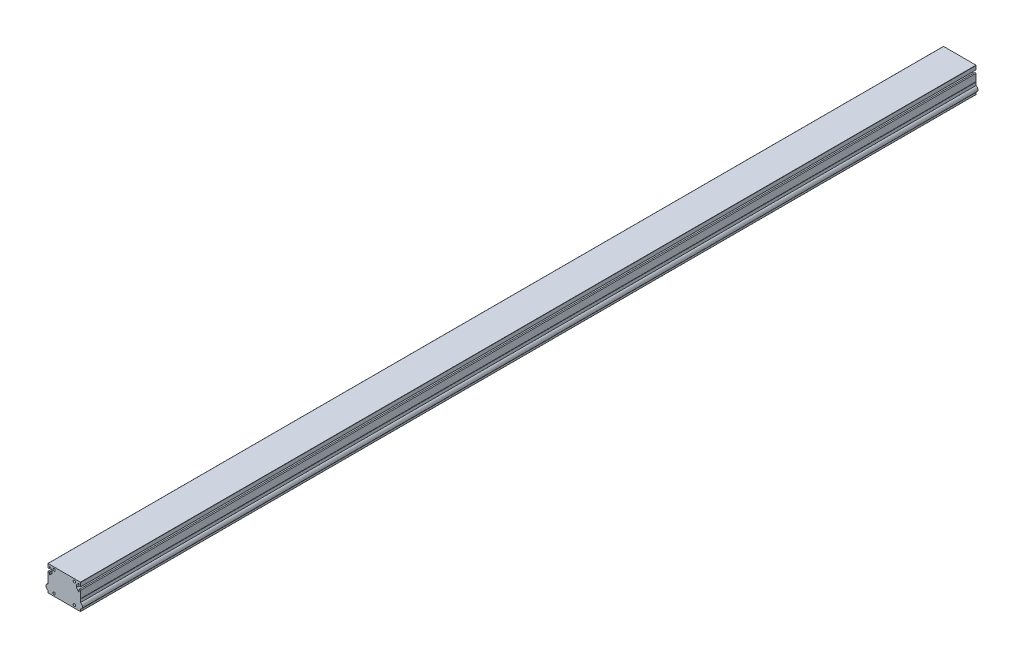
ISO-10303-21;
HEADER;
FILE_DESCRIPTION(('STEP AP214'),'2;1');
FILE_NAME('part.step','',(''),(''),'','','');
FILE_SCHEMA(('AUTOMOTIVE_DESIGN { 1 0 10303 214 1 1 1 1 }'));
ENDSEC;
DATA;
#1=APPLICATION_CONTEXT('core data for automotive mechanical design processes');
#2=APPLICATION_PROTOCOL_DEFINITION('international standard','automotive_design',2000,#1);
#3=PRODUCT_CONTEXT('',#1,'mechanical');
#4=PRODUCT('Part','Part','',(#3));
#5=PRODUCT_RELATED_PRODUCT_CATEGORY('part','',(#4));
#6=PRODUCT_DEFINITION_FORMATION('','',#4);
#7=PRODUCT_DEFINITION_CONTEXT('part definition',#1,'design');
#8=PRODUCT_DEFINITION('design','',#6,#7);
#9=PRODUCT_DEFINITION_SHAPE('','',#8);
#10=(LENGTH_UNIT() NAMED_UNIT(*) SI_UNIT(.MILLI.,.METRE.));
#11=(NAMED_UNIT(*) PLANE_ANGLE_UNIT() SI_UNIT($,.RADIAN.));
#12=(NAMED_UNIT(*) SI_UNIT($,.STERADIAN.) SOLID_ANGLE_UNIT());
#13=UNCERTAINTY_MEASURE_WITH_UNIT(LENGTH_MEASURE(1.E-05),#10,'distance_accuracy_value','');
#14=(GEOMETRIC_REPRESENTATION_CONTEXT(3) GLOBAL_UNCERTAINTY_ASSIGNED_CONTEXT((#13)) GLOBAL_UNIT_ASSIGNED_CONTEXT((#10,
#11,#12)) REPRESENTATION_CONTEXT('',''));
#15=CARTESIAN_POINT('',(0.,0.,0.));
#16=DIRECTION('',(0.,0.,1.));
#17=DIRECTION('',(1.,0.,0.));
#18=AXIS2_PLACEMENT_3D('',#15,#16,#17);
#19=CARTESIAN_POINT('',(-45.,35.,2460.));
#20=DIRECTION('',(0.,0.,1.));
#21=DIRECTION('',(1.,0.,0.));
#22=AXIS2_PLACEMENT_3D('',#19,#20,#21);
#23=PLANE('',#22);
#24=CARTESIAN_POINT('',(28.,28.,2460.));
#25=DIRECTION('',(0.,0.,-1.));
#26=DIRECTION('',(-1.,0.,0.));
#27=AXIS2_PLACEMENT_3D('',#24,#25,#26);
#28=CIRCLE('',#27,3.34999999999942);
#29=CARTESIAN_POINT('',(24.6500000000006,28.,2460.));
#30=VERTEX_POINT('',#29);
#31=EDGE_CURVE('E357',#30,#30,#28,.T.);
#32=ORIENTED_EDGE('',*,*,#31,.T.);
#33=EDGE_LOOP('',(#32));
#34=FACE_BOUND('',#33,.T.);
#35=CARTESIAN_POINT('',(-28.,28.,2460.));
#36=DIRECTION('',(0.,0.,-1.));
#37=DIRECTION('',(-1.,0.,0.));
#38=AXIS2_PLACEMENT_3D('',#35,#36,#37);
#39=CIRCLE('',#38,3.34999999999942);
#40=CARTESIAN_POINT('',(-31.3499999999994,28.,2460.));
#41=VERTEX_POINT('',#40);
#42=EDGE_CURVE('E464',#41,#41,#39,.T.);
#43=ORIENTED_EDGE('',*,*,#42,.T.);
#44=EDGE_LOOP('',(#43));
#45=FACE_BOUND('',#44,.T.);
#46=CARTESIAN_POINT('',(-28.,-28.,2460.));
#47=DIRECTION('',(0.,0.,-1.));
#48=DIRECTION('',(-1.,0.,0.));
#49=AXIS2_PLACEMENT_3D('',#46,#47,#48);
#50=CIRCLE('',#49,3.34999999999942);
#51=CARTESIAN_POINT('',(-31.3499999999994,-28.,2460.));
#52=VERTEX_POINT('',#51);
#53=EDGE_CURVE('E435',#52,#52,#50,.T.);
#54=ORIENTED_EDGE('',*,*,#53,.T.);
#55=EDGE_LOOP('',(#54));
#56=FACE_BOUND('',#55,.T.);
#57=DIRECTION('',(0.,1.,0.));
#58=VECTOR('',#57,1.);
#59=CARTESIAN_POINT('',(45.,35.,2460.));
#60=LINE('',#59,#58);
#61=CARTESIAN_POINT('',(45.,24.05,2460.));
#62=VERTEX_POINT('',#61);
#63=CARTESIAN_POINT('',(45.,34.5,2460.));
#64=VERTEX_POINT('',#63);
#65=EDGE_CURVE('E578',#62,#64,#60,.T.);
#66=ORIENTED_EDGE('',*,*,#65,.T.);
#67=CARTESIAN_POINT('',(44.5,34.5,2460.));
#68=DIRECTION('',(0.,0.,1.));
#69=DIRECTION('',(1.,0.,0.));
#70=AXIS2_PLACEMENT_3D('',#67,#68,#69);
#71=CIRCLE('',#70,0.5);
#72=CARTESIAN_POINT('',(44.5,35.,2460.));
#73=VERTEX_POINT('',#72);
#74=EDGE_CURVE('E646',#64,#73,#71,.T.);
#75=ORIENTED_EDGE('',*,*,#74,.T.);
#76=DIRECTION('',(-1.,0.,0.));
#77=VECTOR('',#76,1.);
#78=CARTESIAN_POINT('',(-45.,35.,2460.));
#79=LINE('',#78,#77);
#80=CARTESIAN_POINT('',(-44.5,35.,2460.));
#81=VERTEX_POINT('',#80);
#82=EDGE_CURVE('E581',#73,#81,#79,.T.);
#83=ORIENTED_EDGE('',*,*,#82,.T.);
#84=CARTESIAN_POINT('',(-44.5,34.5,2460.));
#85=DIRECTION('',(0.,0.,1.));
#86=DIRECTION('',(1.,0.,0.));
#87=AXIS2_PLACEMENT_3D('',#84,#85,#86);
#88=CIRCLE('',#87,0.5);
#89=CARTESIAN_POINT('',(-45.,34.5,2460.));
#90=VERTEX_POINT('',#89);
#91=EDGE_CURVE('E47',#81,#90,#88,.T.);
#92=ORIENTED_EDGE('',*,*,#91,.T.);
#93=DIRECTION('',(0.,-1.,0.));
#94=VECTOR('',#93,1.);
#95=CARTESIAN_POINT('',(-45.,35.,2460.));
#96=LINE('',#95,#94);
#97=CARTESIAN_POINT('',(-45.,24.05,2460.));
#98=VERTEX_POINT('',#97);
#99=EDGE_CURVE('E572',#90,#98,#96,.T.);
#100=ORIENTED_EDGE('',*,*,#99,.T.);
#101=DIRECTION('',(1.,0.,0.));
#102=VECTOR('',#101,1.);
#103=CARTESIAN_POINT('',(-45.,24.05,2460.));
#104=LINE('',#103,#102);
#105=CARTESIAN_POINT('',(-41.5,24.05,2460.));
#106=VERTEX_POINT('',#105);
#107=EDGE_CURVE('E481',#98,#106,#104,.T.);
#108=ORIENTED_EDGE('',*,*,#107,.T.);
#109=CARTESIAN_POINT('',(-41.5,24.55,2460.));
#110=DIRECTION('',(0.,0.,1.));
#111=DIRECTION('',(1.,0.,0.));
#112=AXIS2_PLACEMENT_3D('',#109,#110,#111);
#113=CIRCLE('',#112,0.500000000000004);
#114=CARTESIAN_POINT('',(-41.,24.55,2460.));
#115=VERTEX_POINT('',#114);
#116=EDGE_CURVE('E484',#106,#115,#113,.T.);
#117=ORIENTED_EDGE('',*,*,#116,.T.);
#118=DIRECTION('',(0.,1.,0.));
#119=VECTOR('',#118,1.);
#120=CARTESIAN_POINT('',(-41.,24.55,2460.));
#121=LINE('',#120,#119);
#122=CARTESIAN_POINT('',(-41.,30.,2460.));
#123=VERTEX_POINT('',#122);
#124=EDGE_CURVE('E488',#115,#123,#121,.T.);
#125=ORIENTED_EDGE('',*,*,#124,.T.);
#126=CARTESIAN_POINT('',(-40.5,30.,2460.));
#127=DIRECTION('',(0.,0.,-1.));
#128=DIRECTION('',(1.,0.,0.));
#129=AXIS2_PLACEMENT_3D('',#126,#127,#128);
#130=CIRCLE('',#129,0.499999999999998);
#131=CARTESIAN_POINT('',(-40.1464466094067,30.3535533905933,2460.));
#132=VERTEX_POINT('',#131);
#133=EDGE_CURVE('E491',#123,#132,#130,.T.);
#134=ORIENTED_EDGE('',*,*,#133,.T.);
#135=DIRECTION('',(0.707106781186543,-0.707106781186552,0.));
#136=VECTOR('',#135,1.);
#137=CARTESIAN_POINT('',(-40.1464466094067,30.3535533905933,2460.));
#138=LINE('',#137,#136);
#139=CARTESIAN_POINT('',(-33.2,23.4071067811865,2460.));
#140=VERTEX_POINT('',#139);
#141=EDGE_CURVE('E494',#132,#140,#138,.T.);
#142=ORIENTED_EDGE('',*,*,#141,.T.);
#143=DIRECTION('',(0.,-1.,0.));
#144=VECTOR('',#143,1.);
#145=CARTESIAN_POINT('',(-33.2,23.4071067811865,2460.));
#146=LINE('',#145,#144);
#147=CARTESIAN_POINT('',(-33.2,16.5928932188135,2460.));
#148=VERTEX_POINT('',#147);
#149=EDGE_CURVE('E497',#140,#148,#146,.T.);
#150=ORIENTED_EDGE('',*,*,#149,.T.);
#151=DIRECTION('',(-0.707106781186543,-0.707106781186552,0.));
#152=VECTOR('',#151,1.);
#153=CARTESIAN_POINT('',(-40.1464466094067,9.64644660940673,2460.));
#154=LINE('',#153,#152);
#155=CARTESIAN_POINT('',(-40.1464466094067,9.64644660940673,2460.));
#156=VERTEX_POINT('',#155);
#157=EDGE_CURVE('E500',#148,#156,#154,.T.);
#158=ORIENTED_EDGE('',*,*,#157,.T.);
#159=CARTESIAN_POINT('',(-40.5,10.,2460.));
#160=DIRECTION('',(0.,0.,-1.));
#161=DIRECTION('',(-1.,0.,0.));
#162=AXIS2_PLACEMENT_3D('',#159,#160,#161);
#163=CIRCLE('',#162,0.499999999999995);
#164=CARTESIAN_POINT('',(-41.,10.,2460.));
#165=VERTEX_POINT('',#164);
#166=EDGE_CURVE('E503',#156,#165,#163,.T.);
#167=ORIENTED_EDGE('',*,*,#166,.T.);
#168=DIRECTION('',(0.,1.,0.));
#169=VECTOR('',#168,1.);
#170=CARTESIAN_POINT('',(-41.,15.45,2460.));
#171=LINE('',#170,#169);
#172=CARTESIAN_POINT('',(-41.,15.45,2460.));
#173=VERTEX_POINT('',#172);
#174=EDGE_CURVE('E506',#165,#173,#171,.T.);
#175=ORIENTED_EDGE('',*,*,#174,.T.);
#176=CARTESIAN_POINT('',(-41.5,15.45,2460.));
#177=DIRECTION('',(0.,0.,1.));
#178=DIRECTION('',(-1.,0.,0.));
#179=AXIS2_PLACEMENT_3D('',#176,#177,#178);
#180=CIRCLE('',#179,0.500000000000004);
#181=CARTESIAN_POINT('',(-41.5,15.95,2460.));
#182=VERTEX_POINT('',#181);
#183=EDGE_CURVE('E509',#173,#182,#180,.T.);
#184=ORIENTED_EDGE('',*,*,#183,.T.);
#185=DIRECTION('',(-1.,0.,0.));
#186=VECTOR('',#185,1.);
#187=CARTESIAN_POINT('',(-45.,15.95,2460.));
#188=LINE('',#187,#186);
#189=CARTESIAN_POINT('',(-45.,15.95,2460.));
#190=VERTEX_POINT('',#189);
#191=EDGE_CURVE('E512',#182,#190,#188,.T.);
#192=ORIENTED_EDGE('',*,*,#191,.T.);
#193=CARTESIAN_POINT('',(-45.,-3.8,2460.));
#194=VERTEX_POINT('',#193);
#195=EDGE_CURVE('E575',#190,#194,#96,.T.);
#196=ORIENTED_EDGE('',*,*,#195,.T.);
#197=CARTESIAN_POINT('',(-45.,-4.4,2460.));
#198=DIRECTION('',(0.,0.,-1.));
#199=DIRECTION('',(-1.,0.,0.));
#200=AXIS2_PLACEMENT_3D('',#197,#198,#199);
#201=CIRCLE('',#200,0.6);
#202=CARTESIAN_POINT('',(-45.,-5.,2460.));
#203=VERTEX_POINT('',#202);
#204=EDGE_CURVE('E471',#194,#203,#201,.T.);
#205=ORIENTED_EDGE('',*,*,#204,.T.);
#206=CARTESIAN_POINT('',(-45.,-13.0985760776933,2460.));
#207=VERTEX_POINT('',#206);
#208=EDGE_CURVE('E667',#203,#207,#96,.T.);
#209=ORIENTED_EDGE('',*,*,#208,.T.);
#210=CARTESIAN_POINT('',(-44.7,-13.0985760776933,2460.));
#211=DIRECTION('',(0.,0.,1.));
#212=DIRECTION('',(1.,0.,0.));
#213=AXIS2_PLACEMENT_3D('',#210,#211,#212);
#214=CIRCLE('',#213,0.3);
#215=CARTESIAN_POINT('',(-44.602994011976,-13.3824595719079,2460.));
#216=VERTEX_POINT('',#215);
#217=EDGE_CURVE('E610',#207,#216,#214,.T.);
#218=ORIENTED_EDGE('',*,*,#217,.T.);
#219=CARTESIAN_POINT('',(-42.,-21.,2460.));
#220=DIRECTION('',(0.,0.,1.));
#221=DIRECTION('',(1.,0.,0.));
#222=AXIS2_PLACEMENT_3D('',#219,#220,#221);
#223=CIRCLE('',#222,8.05);
#224=CARTESIAN_POINT('',(-44.602994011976,-28.6175404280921,2460.));
#225=VERTEX_POINT('',#224);
#226=EDGE_CURVE('E334',#225,#216,#223,.F.);
#227=ORIENTED_EDGE('',*,*,#226,.F.);
#228=CARTESIAN_POINT('',(-44.7,-28.9014239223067,2460.));
#229=DIRECTION('',(0.,0.,1.));
#230=DIRECTION('',(1.,0.,0.));
#231=AXIS2_PLACEMENT_3D('',#228,#229,#230);
#232=CIRCLE('',#231,0.3);
#233=CARTESIAN_POINT('',(-45.,-28.9014239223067,2460.));
#234=VERTEX_POINT('',#233);
#235=EDGE_CURVE('E612',#225,#234,#232,.T.);
#236=ORIENTED_EDGE('',*,*,#235,.T.);
#237=CARTESIAN_POINT('',(-45.,-34.5,2460.));
#238=VERTEX_POINT('',#237);
#239=EDGE_CURVE('E576',#234,#238,#96,.T.);
#240=ORIENTED_EDGE('',*,*,#239,.T.);
#241=CARTESIAN_POINT('',(-44.5,-34.5,2460.));
#242=DIRECTION('',(0.,0.,1.));
#243=DIRECTION('',(1.,0.,0.));
#244=AXIS2_PLACEMENT_3D('',#241,#242,#243);
#245=CIRCLE('',#244,0.5);
#246=CARTESIAN_POINT('',(-44.5,-35.,2460.));
#247=VERTEX_POINT('',#246);
#248=EDGE_CURVE('E643',#238,#247,#245,.T.);
#249=ORIENTED_EDGE('',*,*,#248,.T.);
#250=DIRECTION('',(1.,0.,0.));
#251=VECTOR('',#250,1.);
#252=CARTESIAN_POINT('',(-45.,-35.,2460.));
#253=LINE('',#252,#251);
#254=CARTESIAN_POINT('',(44.5,-35.,2460.));
#255=VERTEX_POINT('',#254);
#256=EDGE_CURVE('E574',#247,#255,#253,.T.);
#257=ORIENTED_EDGE('',*,*,#256,.T.);
#258=CARTESIAN_POINT('',(44.5,-34.5,2460.));
#259=DIRECTION('',(0.,0.,1.));
#260=DIRECTION('',(1.,0.,0.));
#261=AXIS2_PLACEMENT_3D('',#258,#259,#260);
#262=CIRCLE('',#261,0.5);
#263=CARTESIAN_POINT('',(45.,-34.5,2460.));
#264=VERTEX_POINT('',#263);
#265=EDGE_CURVE('E54',#255,#264,#262,.T.);
#266=ORIENTED_EDGE('',*,*,#265,.T.);
#267=CARTESIAN_POINT('',(45.,-28.9014239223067,2460.));
#268=VERTEX_POINT('',#267);
#269=EDGE_CURVE('E579',#264,#268,#60,.T.);
#270=ORIENTED_EDGE('',*,*,#269,.T.);
#271=CARTESIAN_POINT('',(44.7,-28.9014239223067,2460.));
#272=DIRECTION('',(0.,0.,1.));
#273=DIRECTION('',(1.,0.,0.));
#274=AXIS2_PLACEMENT_3D('',#271,#272,#273);
#275=CIRCLE('',#274,0.3);
#276=CARTESIAN_POINT('',(44.6029940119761,-28.6175404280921,2460.));
#277=VERTEX_POINT('',#276);
#278=EDGE_CURVE('E608',#268,#277,#275,.T.);
#279=ORIENTED_EDGE('',*,*,#278,.T.);
#280=CARTESIAN_POINT('',(42.,-21.,2460.));
#281=DIRECTION('',(0.,0.,1.));
#282=DIRECTION('',(1.,0.,0.));
#283=AXIS2_PLACEMENT_3D('',#280,#281,#282);
#284=CIRCLE('',#283,8.05);
#285=CARTESIAN_POINT('',(44.6029940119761,-13.3824595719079,2460.));
#286=VERTEX_POINT('',#285);
#287=EDGE_CURVE('E348',#286,#277,#284,.F.);
#288=ORIENTED_EDGE('',*,*,#287,.F.);
#289=CARTESIAN_POINT('',(44.7,-13.0985760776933,2460.));
#290=DIRECTION('',(0.,0.,1.));
#291=DIRECTION('',(1.,0.,0.));
#292=AXIS2_PLACEMENT_3D('',#289,#290,#291);
#293=CIRCLE('',#292,0.3);
#294=CARTESIAN_POINT('',(45.,-13.0985760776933,2460.));
#295=VERTEX_POINT('',#294);
#296=EDGE_CURVE('E606',#286,#295,#293,.T.);
#297=ORIENTED_EDGE('',*,*,#296,.T.);
#298=CARTESIAN_POINT('',(45.,-5.,2460.));
#299=VERTEX_POINT('',#298);
#300=EDGE_CURVE('E582',#295,#299,#60,.T.);
#301=ORIENTED_EDGE('',*,*,#300,.T.);
#302=CARTESIAN_POINT('',(45.,-4.4,2460.));
#303=DIRECTION('',(0.,0.,1.));
#304=DIRECTION('',(1.,0.,0.));
#305=AXIS2_PLACEMENT_3D('',#302,#303,#304);
#306=CIRCLE('',#305,0.6);
#307=CARTESIAN_POINT('',(45.,-3.8,2460.));
#308=VERTEX_POINT('',#307);
#309=EDGE_CURVE('E364',#308,#299,#306,.T.);
#310=ORIENTED_EDGE('',*,*,#309,.F.);
#311=CARTESIAN_POINT('',(45.,15.95,2460.));
#312=VERTEX_POINT('',#311);
#313=EDGE_CURVE('E699',#308,#312,#60,.T.);
#314=ORIENTED_EDGE('',*,*,#313,.T.);
#315=DIRECTION('',(1.,0.,0.));
#316=VECTOR('',#315,1.);
#317=CARTESIAN_POINT('',(45.,15.95,2460.));
#318=LINE('',#317,#316);
#319=CARTESIAN_POINT('',(41.5,15.95,2460.));
#320=VERTEX_POINT('',#319);
#321=EDGE_CURVE('E378',#320,#312,#318,.T.);
#322=ORIENTED_EDGE('',*,*,#321,.F.);
#323=CARTESIAN_POINT('',(41.5,15.45,2460.));
#324=DIRECTION('',(0.,0.,-1.));
#325=DIRECTION('',(1.,0.,0.));
#326=AXIS2_PLACEMENT_3D('',#323,#324,#325);
#327=CIRCLE('',#326,0.500000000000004);
#328=CARTESIAN_POINT('',(41.,15.45,2460.));
#329=VERTEX_POINT('',#328);
#330=EDGE_CURVE('E382',#329,#320,#327,.T.);
#331=ORIENTED_EDGE('',*,*,#330,.F.);
#332=DIRECTION('',(0.,1.,0.));
#333=VECTOR('',#332,1.);
#334=CARTESIAN_POINT('',(41.,15.45,2460.));
#335=LINE('',#334,#333);
#336=CARTESIAN_POINT('',(41.,10.,2460.));
#337=VERTEX_POINT('',#336);
#338=EDGE_CURVE('E384',#337,#329,#335,.T.);
#339=ORIENTED_EDGE('',*,*,#338,.F.);
#340=CARTESIAN_POINT('',(40.5,10.,2460.));
#341=DIRECTION('',(0.,0.,1.));
#342=DIRECTION('',(1.,0.,0.));
#343=AXIS2_PLACEMENT_3D('',#340,#341,#342);
#344=CIRCLE('',#343,0.499999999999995);
#345=CARTESIAN_POINT('',(40.1464466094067,9.64644660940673,2460.));
#346=VERTEX_POINT('',#345);
#347=EDGE_CURVE('E386',#346,#337,#344,.T.);
#348=ORIENTED_EDGE('',*,*,#347,.F.);
#349=DIRECTION('',(0.707106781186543,-0.707106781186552,0.));
#350=VECTOR('',#349,1.);
#351=CARTESIAN_POINT('',(40.1464466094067,9.64644660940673,2460.));
#352=LINE('',#351,#350);
#353=CARTESIAN_POINT('',(33.2,16.5928932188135,2460.));
#354=VERTEX_POINT('',#353);
#355=EDGE_CURVE('E388',#354,#346,#352,.T.);
#356=ORIENTED_EDGE('',*,*,#355,.F.);
#357=DIRECTION('',(0.,-1.,0.));
#358=VECTOR('',#357,1.);
#359=CARTESIAN_POINT('',(33.2,23.4071067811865,2460.));
#360=LINE('',#359,#358);
#361=CARTESIAN_POINT('',(33.2,23.4071067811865,2460.));
#362=VERTEX_POINT('',#361);
#363=EDGE_CURVE('E390',#362,#354,#360,.T.);
#364=ORIENTED_EDGE('',*,*,#363,.F.);
#365=DIRECTION('',(-0.707106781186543,-0.707106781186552,0.));
#366=VECTOR('',#365,1.);
#367=CARTESIAN_POINT('',(40.1464466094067,30.3535533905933,2460.));
#368=LINE('',#367,#366);
#369=CARTESIAN_POINT('',(40.1464466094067,30.3535533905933,2460.));
#370=VERTEX_POINT('',#369);
#371=EDGE_CURVE('E392',#370,#362,#368,.T.);
#372=ORIENTED_EDGE('',*,*,#371,.F.);
#373=CARTESIAN_POINT('',(40.5,30.,2460.));
#374=DIRECTION('',(0.,0.,1.));
#375=DIRECTION('',(-1.,0.,0.));
#376=AXIS2_PLACEMENT_3D('',#373,#374,#375);
#377=CIRCLE('',#376,0.499999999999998);
#378=CARTESIAN_POINT('',(41.,30.,2460.));
#379=VERTEX_POINT('',#378);
#380=EDGE_CURVE('E394',#379,#370,#377,.T.);
#381=ORIENTED_EDGE('',*,*,#380,.F.);
#382=DIRECTION('',(0.,1.,0.));
#383=VECTOR('',#382,1.);
#384=CARTESIAN_POINT('',(41.,24.55,2460.));
#385=LINE('',#384,#383);
#386=CARTESIAN_POINT('',(41.,24.55,2460.));
#387=VERTEX_POINT('',#386);
#388=EDGE_CURVE('E396',#387,#379,#385,.T.);
#389=ORIENTED_EDGE('',*,*,#388,.F.);
#390=CARTESIAN_POINT('',(41.5,24.55,2460.));
#391=DIRECTION('',(0.,0.,-1.));
#392=DIRECTION('',(-1.,0.,0.));
#393=AXIS2_PLACEMENT_3D('',#390,#391,#392);
#394=CIRCLE('',#393,0.500000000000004);
#395=CARTESIAN_POINT('',(41.5,24.05,2460.));
#396=VERTEX_POINT('',#395);
#397=EDGE_CURVE('E398',#396,#387,#394,.T.);
#398=ORIENTED_EDGE('',*,*,#397,.F.);
#399=DIRECTION('',(-1.,0.,0.));
#400=VECTOR('',#399,1.);
#401=CARTESIAN_POINT('',(45.,24.05,2460.));
#402=LINE('',#401,#400);
#403=EDGE_CURVE('E376',#62,#396,#402,.T.);
#404=ORIENTED_EDGE('',*,*,#403,.F.);
#405=EDGE_LOOP('',(#66,#75,#83,#92,#100,#108,#117,#125,#134,#142,#150,#158,#167,#175,#184,#192,
#196,#205,#209,#218,#227,#236,#240,#249,#257,#266,#270,#279,#288,#297,#301,#310,#314,#322,#331,
#339,#348,#356,#364,#372,#381,#389,#398,#404));
#406=FACE_BOUND('',#405,.T.);
#407=CARTESIAN_POINT('',(28.,-28.,2460.));
#408=DIRECTION('',(0.,0.,-1.));
#409=DIRECTION('',(-1.,0.,0.));
#410=AXIS2_PLACEMENT_3D('',#407,#408,#409);
#411=CIRCLE('',#410,3.34999999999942);
#412=CARTESIAN_POINT('',(24.6500000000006,-28.,2460.));
#413=VERTEX_POINT('',#412);
#414=EDGE_CURVE('E351',#413,#413,#411,.T.);
#415=ORIENTED_EDGE('',*,*,#414,.T.);
#416=EDGE_LOOP('',(#415));
#417=FACE_BOUND('',#416,.T.);
#418=ADVANCED_FACE('F32',(#34,#45,#56,#406,#417),#23,.T.);
#419=CARTESIAN_POINT('',(-45.,35.,0.));
#420=DIRECTION('',(0.,0.,1.));
#421=DIRECTION('',(1.,0.,0.));
#422=AXIS2_PLACEMENT_3D('',#419,#420,#421);
#423=PLANE('',#422);
#424=CARTESIAN_POINT('',(28.,28.,0.));
#425=DIRECTION('',(0.,0.,-1.));
#426=DIRECTION('',(-1.,0.,0.));
#427=AXIS2_PLACEMENT_3D('',#424,#425,#426);
#428=CIRCLE('',#427,3.34999999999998);
#429=CARTESIAN_POINT('',(24.65,28.,0.));
#430=VERTEX_POINT('',#429);
#431=EDGE_CURVE('E360',#430,#430,#428,.T.);
#432=ORIENTED_EDGE('',*,*,#431,.F.);
#433=EDGE_LOOP('',(#432));
#434=FACE_BOUND('',#433,.T.);
#435=CARTESIAN_POINT('',(-28.,28.,0.));
#436=DIRECTION('',(0.,0.,-1.));
#437=DIRECTION('',(-1.,0.,0.));
#438=AXIS2_PLACEMENT_3D('',#435,#436,#437);
#439=CIRCLE('',#438,3.34999999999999);
#440=CARTESIAN_POINT('',(-31.35,28.,0.));
#441=VERTEX_POINT('',#440);
#442=EDGE_CURVE('E467',#441,#441,#439,.T.);
#443=ORIENTED_EDGE('',*,*,#442,.F.);
#444=EDGE_LOOP('',(#443));
#445=FACE_BOUND('',#444,.T.);
#446=CARTESIAN_POINT('',(-28.,-28.,0.));
#447=DIRECTION('',(0.,0.,-1.));
#448=DIRECTION('',(-1.,0.,0.));
#449=AXIS2_PLACEMENT_3D('',#446,#447,#448);
#450=CIRCLE('',#449,3.34999999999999);
#451=CARTESIAN_POINT('',(-31.35,-28.,0.));
#452=VERTEX_POINT('',#451);
#453=EDGE_CURVE('E461',#452,#452,#450,.T.);
#454=ORIENTED_EDGE('',*,*,#453,.F.);
#455=EDGE_LOOP('',(#454));
#456=FACE_BOUND('',#455,.T.);
#457=DIRECTION('',(-1.,0.,0.));
#458=VECTOR('',#457,1.);
#459=CARTESIAN_POINT('',(-45.,35.,0.));
#460=LINE('',#459,#458);
#461=CARTESIAN_POINT('',(44.5,35.,0.));
#462=VERTEX_POINT('',#461);
#463=CARTESIAN_POINT('',(-44.5,35.,0.));
#464=VERTEX_POINT('',#463);
#465=EDGE_CURVE('E594',#462,#464,#460,.T.);
#466=ORIENTED_EDGE('',*,*,#465,.F.);
#467=CARTESIAN_POINT('',(44.5,34.5,0.));
#468=DIRECTION('',(0.,0.,1.));
#469=DIRECTION('',(1.,0.,0.));
#470=AXIS2_PLACEMENT_3D('',#467,#468,#469);
#471=CIRCLE('',#470,0.5);
#472=CARTESIAN_POINT('',(45.,34.5,0.));
#473=VERTEX_POINT('',#472);
#474=EDGE_CURVE('E638',#462,#473,#471,.F.);
#475=ORIENTED_EDGE('',*,*,#474,.T.);
#476=DIRECTION('',(0.,1.,0.));
#477=VECTOR('',#476,1.);
#478=CARTESIAN_POINT('',(45.,35.,0.));
#479=LINE('',#478,#477);
#480=CARTESIAN_POINT('',(45.,24.05,0.));
#481=VERTEX_POINT('',#480);
#482=EDGE_CURVE('E591',#481,#473,#479,.T.);
#483=ORIENTED_EDGE('',*,*,#482,.F.);
#484=DIRECTION('',(-1.,0.,0.));
#485=VECTOR('',#484,1.);
#486=CARTESIAN_POINT('',(45.,24.05,0.));
#487=LINE('',#486,#485);
#488=CARTESIAN_POINT('',(41.5,24.05,0.));
#489=VERTEX_POINT('',#488);
#490=EDGE_CURVE('E373',#481,#489,#487,.T.);
#491=ORIENTED_EDGE('',*,*,#490,.T.);
#492=CARTESIAN_POINT('',(41.5,24.55,0.));
#493=DIRECTION('',(0.,0.,-1.));
#494=DIRECTION('',(-1.,0.,0.));
#495=AXIS2_PLACEMENT_3D('',#492,#493,#494);
#496=CIRCLE('',#495,0.500000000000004);
#497=CARTESIAN_POINT('',(41.,24.55,0.));
#498=VERTEX_POINT('',#497);
#499=EDGE_CURVE('E379',#489,#498,#496,.T.);
#500=ORIENTED_EDGE('',*,*,#499,.T.);
#501=DIRECTION('',(0.,1.,0.));
#502=VECTOR('',#501,1.);
#503=CARTESIAN_POINT('',(41.,24.55,0.));
#504=LINE('',#503,#502);
#505=CARTESIAN_POINT('',(41.,30.,0.));
#506=VERTEX_POINT('',#505);
#507=EDGE_CURVE('E427',#498,#506,#504,.T.);
#508=ORIENTED_EDGE('',*,*,#507,.T.);
#509=CARTESIAN_POINT('',(40.5,30.,0.));
#510=DIRECTION('',(0.,0.,1.));
#511=DIRECTION('',(-1.,0.,0.));
#512=AXIS2_PLACEMENT_3D('',#509,#510,#511);
#513=CIRCLE('',#512,0.499999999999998);
#514=CARTESIAN_POINT('',(40.1464466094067,30.3535533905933,0.));
#515=VERTEX_POINT('',#514);
#516=EDGE_CURVE('E424',#506,#515,#513,.T.);
#517=ORIENTED_EDGE('',*,*,#516,.T.);
#518=DIRECTION('',(-0.707106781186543,-0.707106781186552,0.));
#519=VECTOR('',#518,1.);
#520=CARTESIAN_POINT('',(40.1464466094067,30.3535533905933,0.));
#521=LINE('',#520,#519);
#522=CARTESIAN_POINT('',(33.2,23.4071067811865,0.));
#523=VERTEX_POINT('',#522);
#524=EDGE_CURVE('E421',#515,#523,#521,.T.);
#525=ORIENTED_EDGE('',*,*,#524,.T.);
#526=DIRECTION('',(0.,-1.,0.));
#527=VECTOR('',#526,1.);
#528=CARTESIAN_POINT('',(33.2,23.4071067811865,0.));
#529=LINE('',#528,#527);
#530=CARTESIAN_POINT('',(33.2,16.5928932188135,0.));
#531=VERTEX_POINT('',#530);
#532=EDGE_CURVE('E418',#523,#531,#529,.T.);
#533=ORIENTED_EDGE('',*,*,#532,.T.);
#534=DIRECTION('',(0.707106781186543,-0.707106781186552,0.));
#535=VECTOR('',#534,1.);
#536=CARTESIAN_POINT('',(40.1464466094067,9.64644660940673,0.));
#537=LINE('',#536,#535);
#538=CARTESIAN_POINT('',(40.1464466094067,9.64644660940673,0.));
#539=VERTEX_POINT('',#538);
#540=EDGE_CURVE('E415',#531,#539,#537,.T.);
#541=ORIENTED_EDGE('',*,*,#540,.T.);
#542=CARTESIAN_POINT('',(40.5,10.,0.));
#543=DIRECTION('',(0.,0.,1.));
#544=DIRECTION('',(1.,0.,0.));
#545=AXIS2_PLACEMENT_3D('',#542,#543,#544);
#546=CIRCLE('',#545,0.499999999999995);
#547=CARTESIAN_POINT('',(41.,10.,0.));
#548=VERTEX_POINT('',#547);
#549=EDGE_CURVE('E412',#539,#548,#546,.T.);
#550=ORIENTED_EDGE('',*,*,#549,.T.);
#551=DIRECTION('',(0.,1.,0.));
#552=VECTOR('',#551,1.);
#553=CARTESIAN_POINT('',(41.,15.45,0.));
#554=LINE('',#553,#552);
#555=CARTESIAN_POINT('',(41.,15.45,0.));
#556=VERTEX_POINT('',#555);
#557=EDGE_CURVE('E409',#548,#556,#554,.T.);
#558=ORIENTED_EDGE('',*,*,#557,.T.);
#559=CARTESIAN_POINT('',(41.5,15.45,0.));
#560=DIRECTION('',(0.,0.,-1.));
#561=DIRECTION('',(1.,0.,0.));
#562=AXIS2_PLACEMENT_3D('',#559,#560,#561);
#563=CIRCLE('',#562,0.500000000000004);
#564=CARTESIAN_POINT('',(41.5,15.95,0.));
#565=VERTEX_POINT('',#564);
#566=EDGE_CURVE('E406',#556,#565,#563,.T.);
#567=ORIENTED_EDGE('',*,*,#566,.T.);
#568=DIRECTION('',(1.,0.,0.));
#569=VECTOR('',#568,1.);
#570=CARTESIAN_POINT('',(45.,15.95,0.));
#571=LINE('',#570,#569);
#572=CARTESIAN_POINT('',(45.,15.95,0.));
#573=VERTEX_POINT('',#572);
#574=EDGE_CURVE('E403',#565,#573,#571,.T.);
#575=ORIENTED_EDGE('',*,*,#574,.T.);
#576=CARTESIAN_POINT('',(45.,-3.8,0.));
#577=VERTEX_POINT('',#576);
#578=EDGE_CURVE('E1224',#577,#573,#479,.T.);
#579=ORIENTED_EDGE('',*,*,#578,.F.);
#580=CARTESIAN_POINT('',(45.,-4.4,0.));
#581=DIRECTION('',(0.,0.,1.));
#582=DIRECTION('',(1.,0.,0.));
#583=AXIS2_PLACEMENT_3D('',#580,#581,#582);
#584=CIRCLE('',#583,0.6);
#585=CARTESIAN_POINT('',(45.,-5.,0.));
#586=VERTEX_POINT('',#585);
#587=EDGE_CURVE('E363',#577,#586,#584,.T.);
#588=ORIENTED_EDGE('',*,*,#587,.T.);
#589=CARTESIAN_POINT('',(45.,-13.0985760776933,0.));
#590=VERTEX_POINT('',#589);
#591=EDGE_CURVE('E595',#590,#586,#479,.T.);
#592=ORIENTED_EDGE('',*,*,#591,.F.);
#593=CARTESIAN_POINT('',(44.7,-13.0985760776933,0.));
#594=DIRECTION('',(0.,0.,1.));
#595=DIRECTION('',(1.,0.,0.));
#596=AXIS2_PLACEMENT_3D('',#593,#594,#595);
#597=CIRCLE('',#596,0.3);
#598=CARTESIAN_POINT('',(44.6029940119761,-13.382459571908,0.));
#599=VERTEX_POINT('',#598);
#600=EDGE_CURVE('E600',#590,#599,#597,.F.);
#601=ORIENTED_EDGE('',*,*,#600,.T.);
#602=CARTESIAN_POINT('',(42.,-21.,0.));
#603=DIRECTION('',(0.,0.,-1.));
#604=DIRECTION('',(-1.,0.,0.));
#605=AXIS2_PLACEMENT_3D('',#602,#603,#604);
#606=CIRCLE('',#605,8.05);
#607=CARTESIAN_POINT('',(44.6029940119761,-28.6175404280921,0.));
#608=VERTEX_POINT('',#607);
#609=EDGE_CURVE('E343',#599,#608,#606,.T.);
#610=ORIENTED_EDGE('',*,*,#609,.T.);
#611=CARTESIAN_POINT('',(44.7,-28.9014239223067,0.));
#612=DIRECTION('',(0.,0.,1.));
#613=DIRECTION('',(1.,0.,0.));
#614=AXIS2_PLACEMENT_3D('',#611,#612,#613);
#615=CIRCLE('',#614,0.3);
#616=CARTESIAN_POINT('',(45.,-28.9014239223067,0.));
#617=VERTEX_POINT('',#616);
#618=EDGE_CURVE('E326',#608,#617,#615,.F.);
#619=ORIENTED_EDGE('',*,*,#618,.T.);
#620=CARTESIAN_POINT('',(45.,-34.5,0.));
#621=VERTEX_POINT('',#620);
#622=EDGE_CURVE('E592',#621,#617,#479,.T.);
#623=ORIENTED_EDGE('',*,*,#622,.F.);
#624=CARTESIAN_POINT('',(44.5,-34.5,0.));
#625=DIRECTION('',(0.,0.,1.));
#626=DIRECTION('',(1.,0.,0.));
#627=AXIS2_PLACEMENT_3D('',#624,#625,#626);
#628=CIRCLE('',#627,0.5);
#629=CARTESIAN_POINT('',(44.5,-35.,0.));
#630=VERTEX_POINT('',#629);
#631=EDGE_CURVE('E636',#621,#630,#628,.F.);
#632=ORIENTED_EDGE('',*,*,#631,.T.);
#633=DIRECTION('',(1.,0.,0.));
#634=VECTOR('',#633,1.);
#635=CARTESIAN_POINT('',(-45.,-35.,0.));
#636=LINE('',#635,#634);
#637=CARTESIAN_POINT('',(-44.5,-35.,0.));
#638=VERTEX_POINT('',#637);
#639=EDGE_CURVE('E587',#638,#630,#636,.T.);
#640=ORIENTED_EDGE('',*,*,#639,.F.);
#641=CARTESIAN_POINT('',(-44.5,-34.5,0.));
#642=DIRECTION('',(0.,0.,1.));
#643=DIRECTION('',(1.,0.,0.));
#644=AXIS2_PLACEMENT_3D('',#641,#642,#643);
#645=CIRCLE('',#644,0.5);
#646=CARTESIAN_POINT('',(-45.,-34.5,0.));
#647=VERTEX_POINT('',#646);
#648=EDGE_CURVE('E634',#638,#647,#645,.F.);
#649=ORIENTED_EDGE('',*,*,#648,.T.);
#650=DIRECTION('',(0.,-1.,0.));
#651=VECTOR('',#650,1.);
#652=CARTESIAN_POINT('',(-45.,35.,0.));
#653=LINE('',#652,#651);
#654=CARTESIAN_POINT('',(-45.,-28.9014239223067,0.));
#655=VERTEX_POINT('',#654);
#656=EDGE_CURVE('E548',#655,#647,#653,.T.);
#657=ORIENTED_EDGE('',*,*,#656,.F.);
#658=CARTESIAN_POINT('',(-44.7,-28.9014239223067,0.));
#659=DIRECTION('',(0.,0.,1.));
#660=DIRECTION('',(1.,0.,0.));
#661=AXIS2_PLACEMENT_3D('',#658,#659,#660);
#662=CIRCLE('',#661,0.3);
#663=CARTESIAN_POINT('',(-44.602994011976,-28.6175404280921,0.));
#664=VERTEX_POINT('',#663);
#665=EDGE_CURVE('E325',#655,#664,#662,.F.);
#666=ORIENTED_EDGE('',*,*,#665,.T.);
#667=CARTESIAN_POINT('',(-42.,-21.,0.));
#668=DIRECTION('',(0.,0.,-1.));
#669=DIRECTION('',(-1.,0.,0.));
#670=AXIS2_PLACEMENT_3D('',#667,#668,#669);
#671=CIRCLE('',#670,8.05);
#672=CARTESIAN_POINT('',(-44.602994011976,-13.3824595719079,0.));
#673=VERTEX_POINT('',#672);
#674=EDGE_CURVE('E332',#664,#673,#671,.T.);
#675=ORIENTED_EDGE('',*,*,#674,.T.);
#676=CARTESIAN_POINT('',(-44.7,-13.0985760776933,0.));
#677=DIRECTION('',(0.,0.,1.));
#678=DIRECTION('',(1.,0.,0.));
#679=AXIS2_PLACEMENT_3D('',#676,#677,#678);
#680=CIRCLE('',#679,0.3);
#681=CARTESIAN_POINT('',(-45.,-13.0985760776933,0.));
#682=VERTEX_POINT('',#681);
#683=EDGE_CURVE('E314',#673,#682,#680,.F.);
#684=ORIENTED_EDGE('',*,*,#683,.T.);
#685=CARTESIAN_POINT('',(-45.,-5.,0.));
#686=VERTEX_POINT('',#685);
#687=EDGE_CURVE('E778',#686,#682,#653,.T.);
#688=ORIENTED_EDGE('',*,*,#687,.F.);
#689=CARTESIAN_POINT('',(-45.,-4.4,0.));
#690=DIRECTION('',(0.,0.,-1.));
#691=DIRECTION('',(-1.,0.,0.));
#692=AXIS2_PLACEMENT_3D('',#689,#690,#691);
#693=CIRCLE('',#692,0.6);
#694=CARTESIAN_POINT('',(-45.,-3.8,0.));
#695=VERTEX_POINT('',#694);
#696=EDGE_CURVE('E470',#695,#686,#693,.T.);
#697=ORIENTED_EDGE('',*,*,#696,.F.);
#698=CARTESIAN_POINT('',(-45.,15.95,0.));
#699=VERTEX_POINT('',#698);
#700=EDGE_CURVE('E588',#699,#695,#653,.T.);
#701=ORIENTED_EDGE('',*,*,#700,.F.);
#702=DIRECTION('',(-1.,0.,0.));
#703=VECTOR('',#702,1.);
#704=CARTESIAN_POINT('',(-45.,15.95,0.));
#705=LINE('',#704,#703);
#706=CARTESIAN_POINT('',(-41.5,15.95,0.));
#707=VERTEX_POINT('',#706);
#708=EDGE_CURVE('E485',#707,#699,#705,.T.);
#709=ORIENTED_EDGE('',*,*,#708,.F.);
#710=CARTESIAN_POINT('',(-41.5,15.45,0.));
#711=DIRECTION('',(0.,0.,1.));
#712=DIRECTION('',(-1.,0.,0.));
#713=AXIS2_PLACEMENT_3D('',#710,#711,#712);
#714=CIRCLE('',#713,0.500000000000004);
#715=CARTESIAN_POINT('',(-41.,15.45,0.));
#716=VERTEX_POINT('',#715);
#717=EDGE_CURVE('E541',#716,#707,#714,.T.);
#718=ORIENTED_EDGE('',*,*,#717,.F.);
#719=DIRECTION('',(0.,1.,0.));
#720=VECTOR('',#719,1.);
#721=CARTESIAN_POINT('',(-41.,15.45,0.));
#722=LINE('',#721,#720);
#723=CARTESIAN_POINT('',(-41.,10.,0.));
#724=VERTEX_POINT('',#723);
#725=EDGE_CURVE('E538',#724,#716,#722,.T.);
#726=ORIENTED_EDGE('',*,*,#725,.F.);
#727=CARTESIAN_POINT('',(-40.5,10.,0.));
#728=DIRECTION('',(0.,0.,-1.));
#729=DIRECTION('',(-1.,0.,0.));
#730=AXIS2_PLACEMENT_3D('',#727,#728,#729);
#731=CIRCLE('',#730,0.499999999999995);
#732=CARTESIAN_POINT('',(-40.1464466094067,9.64644660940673,0.));
#733=VERTEX_POINT('',#732);
#734=EDGE_CURVE('E535',#733,#724,#731,.T.);
#735=ORIENTED_EDGE('',*,*,#734,.F.);
#736=DIRECTION('',(-0.707106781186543,-0.707106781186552,0.));
#737=VECTOR('',#736,1.);
#738=CARTESIAN_POINT('',(-40.1464466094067,9.64644660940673,0.));
#739=LINE('',#738,#737);
#740=CARTESIAN_POINT('',(-33.2,16.5928932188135,0.));
#741=VERTEX_POINT('',#740);
#742=EDGE_CURVE('E532',#741,#733,#739,.T.);
#743=ORIENTED_EDGE('',*,*,#742,.F.);
#744=DIRECTION('',(0.,-1.,0.));
#745=VECTOR('',#744,1.);
#746=CARTESIAN_POINT('',(-33.2,23.4071067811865,0.));
#747=LINE('',#746,#745);
#748=CARTESIAN_POINT('',(-33.2,23.4071067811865,0.));
#749=VERTEX_POINT('',#748);
#750=EDGE_CURVE('E529',#749,#741,#747,.T.);
#751=ORIENTED_EDGE('',*,*,#750,.F.);
#752=DIRECTION('',(0.707106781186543,-0.707106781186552,0.));
#753=VECTOR('',#752,1.);
#754=CARTESIAN_POINT('',(-40.1464466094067,30.3535533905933,0.));
#755=LINE('',#754,#753);
#756=CARTESIAN_POINT('',(-40.1464466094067,30.3535533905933,0.));
#757=VERTEX_POINT('',#756);
#758=EDGE_CURVE('E526',#757,#749,#755,.T.);
#759=ORIENTED_EDGE('',*,*,#758,.F.);
#760=CARTESIAN_POINT('',(-40.5,30.,0.));
#761=DIRECTION('',(0.,0.,-1.));
#762=DIRECTION('',(1.,0.,0.));
#763=AXIS2_PLACEMENT_3D('',#760,#761,#762);
#764=CIRCLE('',#763,0.499999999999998);
#765=CARTESIAN_POINT('',(-41.,30.,0.));
#766=VERTEX_POINT('',#765);
#767=EDGE_CURVE('E523',#766,#757,#764,.T.);
#768=ORIENTED_EDGE('',*,*,#767,.F.);
#769=DIRECTION('',(0.,1.,0.));
#770=VECTOR('',#769,1.);
#771=CARTESIAN_POINT('',(-41.,24.55,0.));
#772=LINE('',#771,#770);
#773=CARTESIAN_POINT('',(-41.,24.55,0.));
#774=VERTEX_POINT('',#773);
#775=EDGE_CURVE('E520',#774,#766,#772,.T.);
#776=ORIENTED_EDGE('',*,*,#775,.F.);
#777=CARTESIAN_POINT('',(-41.5,24.55,0.));
#778=DIRECTION('',(0.,0.,1.));
#779=DIRECTION('',(1.,0.,0.));
#780=AXIS2_PLACEMENT_3D('',#777,#778,#779);
#781=CIRCLE('',#780,0.500000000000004);
#782=CARTESIAN_POINT('',(-41.5,24.05,0.));
#783=VERTEX_POINT('',#782);
#784=EDGE_CURVE('E517',#783,#774,#781,.T.);
#785=ORIENTED_EDGE('',*,*,#784,.F.);
#786=DIRECTION('',(1.,0.,0.));
#787=VECTOR('',#786,1.);
#788=CARTESIAN_POINT('',(-45.,24.05,0.));
#789=LINE('',#788,#787);
#790=CARTESIAN_POINT('',(-45.,24.05,0.));
#791=VERTEX_POINT('',#790);
#792=EDGE_CURVE('E478',#791,#783,#789,.T.);
#793=ORIENTED_EDGE('',*,*,#792,.F.);
#794=CARTESIAN_POINT('',(-45.,34.5,0.));
#795=VERTEX_POINT('',#794);
#796=EDGE_CURVE('E585',#795,#791,#653,.T.);
#797=ORIENTED_EDGE('',*,*,#796,.F.);
#798=CARTESIAN_POINT('',(-44.5,34.5,0.));
#799=DIRECTION('',(0.,0.,1.));
#800=DIRECTION('',(1.,0.,0.));
#801=AXIS2_PLACEMENT_3D('',#798,#799,#800);
#802=CIRCLE('',#801,0.5);
#803=EDGE_CURVE('E632',#795,#464,#802,.F.);
#804=ORIENTED_EDGE('',*,*,#803,.T.);
#805=EDGE_LOOP('',(#466,#475,#483,#491,#500,#508,#517,#525,#533,#541,#550,#558,#567,#575,#579,
#588,#592,#601,#610,#619,#623,#632,#640,#649,#657,#666,#675,#684,#688,#697,#701,#709,#718,#726,
#735,#743,#751,#759,#768,#776,#785,#793,#797,#804));
#806=FACE_BOUND('',#805,.T.);
#807=CARTESIAN_POINT('',(28.,-28.,0.));
#808=DIRECTION('',(0.,0.,-1.));
#809=DIRECTION('',(-1.,0.,0.));
#810=AXIS2_PLACEMENT_3D('',#807,#808,#809);
#811=CIRCLE('',#810,3.34999999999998);
#812=CARTESIAN_POINT('',(24.65,-28.,0.));
#813=VERTEX_POINT('',#812);
#814=EDGE_CURVE('E354',#813,#813,#811,.T.);
#815=ORIENTED_EDGE('',*,*,#814,.F.);
#816=EDGE_LOOP('',(#815));
#817=FACE_BOUND('',#816,.T.);
#818=ADVANCED_FACE('F338',(#434,#445,#456,#806,#817),#423,.F.);
#819=CARTESIAN_POINT('',(45.,35.,2460.));
#820=DIRECTION('',(-1.,0.,0.));
#821=DIRECTION('',(0.,-1.,0.));
#822=AXIS2_PLACEMENT_3D('',#819,#820,#821);
#823=PLANE('',#822);
#824=DIRECTION('',(0.,0.,-1.));
#825=VECTOR('',#824,1.);
#826=CARTESIAN_POINT('',(45.,-3.8,2460.));
#827=LINE('',#826,#825);
#828=EDGE_CURVE('E367',#308,#577,#827,.T.);
#829=ORIENTED_EDGE('',*,*,#828,.T.);
#830=ORIENTED_EDGE('',*,*,#578,.T.);
#831=DIRECTION('',(0.,0.,-1.));
#832=VECTOR('',#831,1.);
#833=CARTESIAN_POINT('',(45.,15.95,2460.));
#834=LINE('',#833,#832);
#835=EDGE_CURVE('E454',#312,#573,#834,.T.);
#836=ORIENTED_EDGE('',*,*,#835,.F.);
#837=ORIENTED_EDGE('',*,*,#313,.F.);
#838=EDGE_LOOP('',(#829,#830,#836,#837));
#839=FACE_BOUND('',#838,.T.);
#840=ADVANCED_FACE('F800',(#839),#823,.F.);
#841=ORIENTED_EDGE('',*,*,#300,.F.);
#842=DIRECTION('',(0.,0.,1.));
#843=VECTOR('',#842,1.);
#844=CARTESIAN_POINT('',(45.,-13.0985760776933,0.));
#845=LINE('',#844,#843);
#846=EDGE_CURVE('E624',#295,#590,#845,.F.);
#847=ORIENTED_EDGE('',*,*,#846,.T.);
#848=ORIENTED_EDGE('',*,*,#591,.T.);
#849=DIRECTION('',(0.,0.,-1.));
#850=VECTOR('',#849,1.);
#851=CARTESIAN_POINT('',(45.,-5.,2460.));
#852=LINE('',#851,#850);
#853=EDGE_CURVE('E370',#299,#586,#852,.T.);
#854=ORIENTED_EDGE('',*,*,#853,.F.);
#855=EDGE_LOOP('',(#841,#847,#848,#854));
#856=FACE_BOUND('',#855,.T.);
#857=ADVANCED_FACE('F697',(#856),#823,.F.);
#858=ORIENTED_EDGE('',*,*,#269,.F.);
#859=DIRECTION('',(0.,0.,-1.));
#860=VECTOR('',#859,1.);
#861=CARTESIAN_POINT('',(45.,-34.5,2460.));
#862=LINE('',#861,#860);
#863=EDGE_CURVE('E648',#264,#621,#862,.T.);
#864=ORIENTED_EDGE('',*,*,#863,.T.);
#865=ORIENTED_EDGE('',*,*,#622,.T.);
#866=DIRECTION('',(0.,0.,1.));
#867=VECTOR('',#866,1.);
#868=CARTESIAN_POINT('',(45.,-28.9014239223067,2460.));
#869=LINE('',#868,#867);
#870=EDGE_CURVE('E621',#617,#268,#869,.T.);
#871=ORIENTED_EDGE('',*,*,#870,.T.);
#872=EDGE_LOOP('',(#858,#864,#865,#871));
#873=FACE_BOUND('',#872,.T.);
#874=ADVANCED_FACE('F679',(#873),#823,.F.);
#875=ORIENTED_EDGE('',*,*,#482,.T.);
#876=DIRECTION('',(0.,0.,-1.));
#877=VECTOR('',#876,1.);
#878=CARTESIAN_POINT('',(45.,34.5,2460.));
#879=LINE('',#878,#877);
#880=EDGE_CURVE('E640',#473,#64,#879,.F.);
#881=ORIENTED_EDGE('',*,*,#880,.T.);
#882=ORIENTED_EDGE('',*,*,#65,.F.);
#883=DIRECTION('',(0.,0.,-1.));
#884=VECTOR('',#883,1.);
#885=CARTESIAN_POINT('',(45.,24.05,2460.));
#886=LINE('',#885,#884);
#887=EDGE_CURVE('E400',#62,#481,#886,.T.);
#888=ORIENTED_EDGE('',*,*,#887,.T.);
#889=EDGE_LOOP('',(#875,#881,#882,#888));
#890=FACE_BOUND('',#889,.T.);
#891=ADVANCED_FACE('F808',(#890),#823,.F.);
#892=CARTESIAN_POINT('',(-45.,35.,2460.));
#893=DIRECTION('',(1.,0.,0.));
#894=DIRECTION('',(0.,1.,0.));
#895=AXIS2_PLACEMENT_3D('',#892,#893,#894);
#896=PLANE('',#895);
#897=ORIENTED_EDGE('',*,*,#687,.T.);
#898=DIRECTION('',(0.,0.,-1.));
#899=VECTOR('',#898,1.);
#900=CARTESIAN_POINT('',(-45.,-13.0985760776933,2460.));
#901=LINE('',#900,#899);
#902=EDGE_CURVE('E320',#682,#207,#901,.F.);
#903=ORIENTED_EDGE('',*,*,#902,.T.);
#904=ORIENTED_EDGE('',*,*,#208,.F.);
#905=DIRECTION('',(0.,0.,-1.));
#906=VECTOR('',#905,1.);
#907=CARTESIAN_POINT('',(-45.,-5.,2460.));
#908=LINE('',#907,#906);
#909=EDGE_CURVE('E474',#203,#686,#908,.T.);
#910=ORIENTED_EDGE('',*,*,#909,.T.);
#911=EDGE_LOOP('',(#897,#903,#904,#910));
#912=FACE_BOUND('',#911,.T.);
#913=ADVANCED_FACE('F777',(#912),#896,.F.);
#914=ORIENTED_EDGE('',*,*,#656,.T.);
#915=DIRECTION('',(0.,0.,-1.));
#916=VECTOR('',#915,1.);
#917=CARTESIAN_POINT('',(-45.,-34.5,2460.));
#918=LINE('',#917,#916);
#919=EDGE_CURVE('E40',#647,#238,#918,.F.);
#920=ORIENTED_EDGE('',*,*,#919,.T.);
#921=ORIENTED_EDGE('',*,*,#239,.F.);
#922=DIRECTION('',(0.,0.,-1.));
#923=VECTOR('',#922,1.);
#924=CARTESIAN_POINT('',(-45.,-28.9014239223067,2460.));
#925=LINE('',#924,#923);
#926=EDGE_CURVE('E584',#234,#655,#925,.T.);
#927=ORIENTED_EDGE('',*,*,#926,.T.);
#928=EDGE_LOOP('',(#914,#920,#921,#927));
#929=FACE_BOUND('',#928,.T.);
#930=ADVANCED_FACE('F660',(#929),#896,.F.);
#931=ORIENTED_EDGE('',*,*,#99,.F.);
#932=DIRECTION('',(0.,0.,-1.));
#933=VECTOR('',#932,1.);
#934=CARTESIAN_POINT('',(-45.,34.5,2460.));
#935=LINE('',#934,#933);
#936=EDGE_CURVE('E11',#90,#795,#935,.T.);
#937=ORIENTED_EDGE('',*,*,#936,.T.);
#938=ORIENTED_EDGE('',*,*,#796,.T.);
#939=DIRECTION('',(0.,0.,-1.));
#940=VECTOR('',#939,1.);
#941=CARTESIAN_POINT('',(-45.,24.05,2460.));
#942=LINE('',#941,#940);
#943=EDGE_CURVE('E545',#98,#791,#942,.T.);
#944=ORIENTED_EDGE('',*,*,#943,.F.);
#945=EDGE_LOOP('',(#931,#937,#938,#944));
#946=FACE_BOUND('',#945,.T.);
#947=ADVANCED_FACE('F722',(#946),#896,.F.);
#948=ORIENTED_EDGE('',*,*,#700,.T.);
#949=DIRECTION('',(0.,0.,-1.));
#950=VECTOR('',#949,1.);
#951=CARTESIAN_POINT('',(-45.,-3.8,2460.));
#952=LINE('',#951,#950);
#953=EDGE_CURVE('E476',#194,#695,#952,.T.);
#954=ORIENTED_EDGE('',*,*,#953,.F.);
#955=ORIENTED_EDGE('',*,*,#195,.F.);
#956=DIRECTION('',(0.,0.,-1.));
#957=VECTOR('',#956,1.);
#958=CARTESIAN_POINT('',(-45.,15.95,2460.));
#959=LINE('',#958,#957);
#960=EDGE_CURVE('E549',#190,#699,#959,.T.);
#961=ORIENTED_EDGE('',*,*,#960,.T.);
#962=EDGE_LOOP('',(#948,#954,#955,#961));
#963=FACE_BOUND('',#962,.T.);
#964=ADVANCED_FACE('F772',(#963),#896,.F.);
#965=CARTESIAN_POINT('',(-45.,-35.,2460.));
#966=DIRECTION('',(0.,1.,0.));
#967=DIRECTION('',(0.,0.,1.));
#968=AXIS2_PLACEMENT_3D('',#965,#966,#967);
#969=PLANE('',#968);
#970=ORIENTED_EDGE('',*,*,#639,.T.);
#971=DIRECTION('',(0.,0.,-1.));
#972=VECTOR('',#971,1.);
#973=CARTESIAN_POINT('',(44.5,-35.,2460.));
#974=LINE('',#973,#972);
#975=EDGE_CURVE('E654',#630,#255,#974,.F.);
#976=ORIENTED_EDGE('',*,*,#975,.T.);
#977=ORIENTED_EDGE('',*,*,#256,.F.);
#978=DIRECTION('',(0.,0.,-1.));
#979=VECTOR('',#978,1.);
#980=CARTESIAN_POINT('',(-44.5,-35.,2460.));
#981=LINE('',#980,#979);
#982=EDGE_CURVE('E651',#247,#638,#981,.T.);
#983=ORIENTED_EDGE('',*,*,#982,.T.);
#984=EDGE_LOOP('',(#970,#976,#977,#983));
#985=FACE_BOUND('',#984,.T.);
#986=ADVANCED_FACE('F672',(#985),#969,.F.);
#987=CARTESIAN_POINT('',(-45.,35.,2460.));
#988=DIRECTION('',(0.,-1.,0.));
#989=DIRECTION('',(0.,0.,-1.));
#990=AXIS2_PLACEMENT_3D('',#987,#988,#989);
#991=PLANE('',#990);
#992=ORIENTED_EDGE('',*,*,#82,.F.);
#993=DIRECTION('',(0.,0.,-1.));
#994=VECTOR('',#993,1.);
#995=CARTESIAN_POINT('',(44.5,35.,2460.));
#996=LINE('',#995,#994);
#997=EDGE_CURVE('E629',#73,#462,#996,.T.);
#998=ORIENTED_EDGE('',*,*,#997,.T.);
#999=ORIENTED_EDGE('',*,*,#465,.T.);
#1000=DIRECTION('',(0.,0.,-1.));
#1001=VECTOR('',#1000,1.);
#1002=CARTESIAN_POINT('',(-44.5,35.,2460.));
#1003=LINE('',#1002,#1001);
#1004=EDGE_CURVE('E627',#464,#81,#1003,.F.);
#1005=ORIENTED_EDGE('',*,*,#1004,.T.);
#1006=EDGE_LOOP('',(#992,#998,#999,#1005));
#1007=FACE_BOUND('',#1006,.T.);
#1008=ADVANCED_FACE('F713',(#1007),#991,.F.);
#1009=CARTESIAN_POINT('',(-45.,24.05,2460.));
#1010=DIRECTION('',(0.,1.,0.));
#1011=DIRECTION('',(0.,0.,1.));
#1012=AXIS2_PLACEMENT_3D('',#1009,#1010,#1011);
#1013=PLANE('',#1012);
#1014=ORIENTED_EDGE('',*,*,#792,.T.);
#1015=DIRECTION('',(0.,0.,-1.));
#1016=VECTOR('',#1015,1.);
#1017=CARTESIAN_POINT('',(-41.5,24.05,2460.));
#1018=LINE('',#1017,#1016);
#1019=EDGE_CURVE('E515',#106,#783,#1018,.T.);
#1020=ORIENTED_EDGE('',*,*,#1019,.F.);
#1021=ORIENTED_EDGE('',*,*,#107,.F.);
#1022=ORIENTED_EDGE('',*,*,#943,.T.);
#1023=EDGE_LOOP('',(#1014,#1020,#1021,#1022));
#1024=FACE_BOUND('',#1023,.T.);
#1025=ADVANCED_FACE('F726',(#1024),#1013,.F.);
#1026=CARTESIAN_POINT('',(-45.,15.95,2460.));
#1027=DIRECTION('',(0.,-1.,0.));
#1028=DIRECTION('',(0.,0.,-1.));
#1029=AXIS2_PLACEMENT_3D('',#1026,#1027,#1028);
#1030=PLANE('',#1029);
#1031=ORIENTED_EDGE('',*,*,#708,.T.);
#1032=ORIENTED_EDGE('',*,*,#960,.F.);
#1033=ORIENTED_EDGE('',*,*,#191,.F.);
#1034=DIRECTION('',(0.,0.,-1.));
#1035=VECTOR('',#1034,1.);
#1036=CARTESIAN_POINT('',(-41.5,15.95,2460.));
#1037=LINE('',#1036,#1035);
#1038=EDGE_CURVE('E552',#182,#707,#1037,.T.);
#1039=ORIENTED_EDGE('',*,*,#1038,.T.);
#1040=EDGE_LOOP('',(#1031,#1032,#1033,#1039));
#1041=FACE_BOUND('',#1040,.T.);
#1042=ADVANCED_FACE('F766',(#1041),#1030,.F.);
#1043=CARTESIAN_POINT('',(-41.5,15.45,2460.));
#1044=DIRECTION('',(0.,0.,-1.));
#1045=DIRECTION('',(-1.,0.,0.));
#1046=AXIS2_PLACEMENT_3D('',#1043,#1044,#1045);
#1047=CYLINDRICAL_SURFACE('',#1046,0.500000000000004);
#1048=ORIENTED_EDGE('',*,*,#717,.T.);
#1049=ORIENTED_EDGE('',*,*,#1038,.F.);
#1050=ORIENTED_EDGE('',*,*,#183,.F.);
#1051=DIRECTION('',(0.,0.,-1.));
#1052=VECTOR('',#1051,1.);
#1053=CARTESIAN_POINT('',(-41.,15.45,2460.));
#1054=LINE('',#1053,#1052);
#1055=EDGE_CURVE('E554',#173,#716,#1054,.T.);
#1056=ORIENTED_EDGE('',*,*,#1055,.T.);
#1057=EDGE_LOOP('',(#1048,#1049,#1050,#1056));
#1058=FACE_BOUND('',#1057,.T.);
#1059=ADVANCED_FACE('F762',(#1058),#1047,.T.);
#1060=CARTESIAN_POINT('',(-41.,15.45,2460.));
#1061=DIRECTION('',(-1.,0.,0.));
#1062=DIRECTION('',(0.,0.,1.));
#1063=AXIS2_PLACEMENT_3D('',#1060,#1061,#1062);
#1064=PLANE('',#1063);
#1065=ORIENTED_EDGE('',*,*,#725,.T.);
#1066=ORIENTED_EDGE('',*,*,#1055,.F.);
#1067=ORIENTED_EDGE('',*,*,#174,.F.);
#1068=DIRECTION('',(0.,0.,-1.));
#1069=VECTOR('',#1068,1.);
#1070=CARTESIAN_POINT('',(-41.,10.,2460.));
#1071=LINE('',#1070,#1069);
#1072=EDGE_CURVE('E556',#165,#724,#1071,.T.);
#1073=ORIENTED_EDGE('',*,*,#1072,.T.);
#1074=EDGE_LOOP('',(#1065,#1066,#1067,#1073));
#1075=FACE_BOUND('',#1074,.T.);
#1076=ADVANCED_FACE('F758',(#1075),#1064,.F.);
#1077=CARTESIAN_POINT('',(-40.5,10.,2460.));
#1078=DIRECTION('',(0.,0.,-1.));
#1079=DIRECTION('',(-1.,0.,0.));
#1080=AXIS2_PLACEMENT_3D('',#1077,#1078,#1079);
#1081=CYLINDRICAL_SURFACE('',#1080,0.499999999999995);
#1082=ORIENTED_EDGE('',*,*,#734,.T.);
#1083=ORIENTED_EDGE('',*,*,#1072,.F.);
#1084=ORIENTED_EDGE('',*,*,#166,.F.);
#1085=DIRECTION('',(0.,0.,-1.));
#1086=VECTOR('',#1085,1.);
#1087=CARTESIAN_POINT('',(-40.1464466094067,9.64644660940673,2460.));
#1088=LINE('',#1087,#1086);
#1089=EDGE_CURVE('E558',#156,#733,#1088,.T.);
#1090=ORIENTED_EDGE('',*,*,#1089,.T.);
#1091=EDGE_LOOP('',(#1082,#1083,#1084,#1090));
#1092=FACE_BOUND('',#1091,.T.);
#1093=ADVANCED_FACE('F754',(#1092),#1081,.F.);
#1094=CARTESIAN_POINT('',(-40.1464466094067,9.64644660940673,2460.));
#1095=DIRECTION('',(0.707106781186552,-0.707106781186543,0.));
#1096=DIRECTION('',(0.707106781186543,0.707106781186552,0.));
#1097=AXIS2_PLACEMENT_3D('',#1094,#1095,#1096);
#1098=PLANE('',#1097);
#1099=ORIENTED_EDGE('',*,*,#742,.T.);
#1100=ORIENTED_EDGE('',*,*,#1089,.F.);
#1101=ORIENTED_EDGE('',*,*,#157,.F.);
#1102=DIRECTION('',(0.,0.,-1.));
#1103=VECTOR('',#1102,1.);
#1104=CARTESIAN_POINT('',(-33.2,16.5928932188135,2460.));
#1105=LINE('',#1104,#1103);
#1106=EDGE_CURVE('E560',#148,#741,#1105,.T.);
#1107=ORIENTED_EDGE('',*,*,#1106,.T.);
#1108=EDGE_LOOP('',(#1099,#1100,#1101,#1107));
#1109=FACE_BOUND('',#1108,.T.);
#1110=ADVANCED_FACE('F750',(#1109),#1098,.F.);
#1111=CARTESIAN_POINT('',(-33.2,23.4071067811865,2460.));
#1112=DIRECTION('',(1.,0.,0.));
#1113=DIRECTION('',(0.,0.,-1.));
#1114=AXIS2_PLACEMENT_3D('',#1111,#1112,#1113);
#1115=PLANE('',#1114);
#1116=ORIENTED_EDGE('',*,*,#750,.T.);
#1117=ORIENTED_EDGE('',*,*,#1106,.F.);
#1118=ORIENTED_EDGE('',*,*,#149,.F.);
#1119=DIRECTION('',(0.,0.,-1.));
#1120=VECTOR('',#1119,1.);
#1121=CARTESIAN_POINT('',(-33.2,23.4071067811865,2460.));
#1122=LINE('',#1121,#1120);
#1123=EDGE_CURVE('E562',#140,#749,#1122,.T.);
#1124=ORIENTED_EDGE('',*,*,#1123,.T.);
#1125=EDGE_LOOP('',(#1116,#1117,#1118,#1124));
#1126=FACE_BOUND('',#1125,.T.);
#1127=ADVANCED_FACE('F746',(#1126),#1115,.F.);
#1128=CARTESIAN_POINT('',(-40.1464466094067,30.3535533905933,2460.));
#1129=DIRECTION('',(0.707106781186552,0.707106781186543,0.));
#1130=DIRECTION('',(-0.707106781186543,0.707106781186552,0.));
#1131=AXIS2_PLACEMENT_3D('',#1128,#1129,#1130);
#1132=PLANE('',#1131);
#1133=ORIENTED_EDGE('',*,*,#758,.T.);
#1134=ORIENTED_EDGE('',*,*,#1123,.F.);
#1135=ORIENTED_EDGE('',*,*,#141,.F.);
#1136=DIRECTION('',(0.,0.,-1.));
#1137=VECTOR('',#1136,1.);
#1138=CARTESIAN_POINT('',(-40.1464466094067,30.3535533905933,2460.));
#1139=LINE('',#1138,#1137);
#1140=EDGE_CURVE('E564',#132,#757,#1139,.T.);
#1141=ORIENTED_EDGE('',*,*,#1140,.T.);
#1142=EDGE_LOOP('',(#1133,#1134,#1135,#1141));
#1143=FACE_BOUND('',#1142,.T.);
#1144=ADVANCED_FACE('F742',(#1143),#1132,.F.);
#1145=CARTESIAN_POINT('',(-40.5,30.,2460.));
#1146=DIRECTION('',(0.,0.,-1.));
#1147=DIRECTION('',(-1.,0.,0.));
#1148=AXIS2_PLACEMENT_3D('',#1145,#1146,#1147);
#1149=CYLINDRICAL_SURFACE('',#1148,0.499999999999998);
#1150=ORIENTED_EDGE('',*,*,#767,.T.);
#1151=ORIENTED_EDGE('',*,*,#1140,.F.);
#1152=ORIENTED_EDGE('',*,*,#133,.F.);
#1153=DIRECTION('',(0.,0.,-1.));
#1154=VECTOR('',#1153,1.);
#1155=CARTESIAN_POINT('',(-41.,30.,2460.));
#1156=LINE('',#1155,#1154);
#1157=EDGE_CURVE('E566',#123,#766,#1156,.T.);
#1158=ORIENTED_EDGE('',*,*,#1157,.T.);
#1159=EDGE_LOOP('',(#1150,#1151,#1152,#1158));
#1160=FACE_BOUND('',#1159,.T.);
#1161=ADVANCED_FACE('F738',(#1160),#1149,.F.);
#1162=CARTESIAN_POINT('',(-41.,24.55,2460.));
#1163=DIRECTION('',(-1.,0.,0.));
#1164=DIRECTION('',(0.,0.,1.));
#1165=AXIS2_PLACEMENT_3D('',#1162,#1163,#1164);
#1166=PLANE('',#1165);
#1167=ORIENTED_EDGE('',*,*,#775,.T.);
#1168=ORIENTED_EDGE('',*,*,#1157,.F.);
#1169=ORIENTED_EDGE('',*,*,#124,.F.);
#1170=DIRECTION('',(0.,0.,-1.));
#1171=VECTOR('',#1170,1.);
#1172=CARTESIAN_POINT('',(-41.,24.55,2460.));
#1173=LINE('',#1172,#1171);
#1174=EDGE_CURVE('E568',#115,#774,#1173,.T.);
#1175=ORIENTED_EDGE('',*,*,#1174,.T.);
#1176=EDGE_LOOP('',(#1167,#1168,#1169,#1175));
#1177=FACE_BOUND('',#1176,.T.);
#1178=ADVANCED_FACE('F734',(#1177),#1166,.F.);
#1179=CARTESIAN_POINT('',(-41.5,24.55,2460.));
#1180=DIRECTION('',(0.,0.,-1.));
#1181=DIRECTION('',(-1.,0.,0.));
#1182=AXIS2_PLACEMENT_3D('',#1179,#1180,#1181);
#1183=CYLINDRICAL_SURFACE('',#1182,0.500000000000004);
#1184=ORIENTED_EDGE('',*,*,#784,.T.);
#1185=ORIENTED_EDGE('',*,*,#1174,.F.);
#1186=ORIENTED_EDGE('',*,*,#116,.F.);
#1187=ORIENTED_EDGE('',*,*,#1019,.T.);
#1188=EDGE_LOOP('',(#1184,#1185,#1186,#1187));
#1189=FACE_BOUND('',#1188,.T.);
#1190=ADVANCED_FACE('F730',(#1189),#1183,.T.);
#1191=CARTESIAN_POINT('',(-45.,-4.4,2460.));
#1192=DIRECTION('',(0.,0.,-1.));
#1193=DIRECTION('',(-1.,0.,0.));
#1194=AXIS2_PLACEMENT_3D('',#1191,#1192,#1193);
#1195=CYLINDRICAL_SURFACE('',#1194,0.6);
#1196=ORIENTED_EDGE('',*,*,#696,.T.);
#1197=ORIENTED_EDGE('',*,*,#909,.F.);
#1198=ORIENTED_EDGE('',*,*,#204,.F.);
#1199=ORIENTED_EDGE('',*,*,#953,.T.);
#1200=EDGE_LOOP('',(#1196,#1197,#1198,#1199));
#1201=FACE_BOUND('',#1200,.T.);
#1202=ADVANCED_FACE('F781',(#1201),#1195,.F.);
#1203=CARTESIAN_POINT('',(-28.,28.,0.));
#1204=DIRECTION('',(0.,0.,-1.));
#1205=DIRECTION('',(-1.,0.,0.));
#1206=AXIS2_PLACEMENT_3D('',#1203,#1204,#1205);
#1207=CYLINDRICAL_SURFACE('',#1206,3.34999999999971);
#1208=ORIENTED_EDGE('',*,*,#42,.F.);
#1209=EDGE_LOOP('',(#1208));
#1210=FACE_BOUND('',#1209,.T.);
#1211=ORIENTED_EDGE('',*,*,#442,.T.);
#1212=EDGE_LOOP('',(#1211));
#1213=FACE_BOUND('',#1212,.T.);
#1214=ADVANCED_FACE('F783',(#1210,#1213),#1207,.F.);
#1215=CARTESIAN_POINT('',(-28.,-28.,0.));
#1216=DIRECTION('',(0.,0.,-1.));
#1217=DIRECTION('',(-1.,0.,0.));
#1218=AXIS2_PLACEMENT_3D('',#1215,#1216,#1217);
#1219=CYLINDRICAL_SURFACE('',#1218,3.34999999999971);
#1220=ORIENTED_EDGE('',*,*,#53,.F.);
#1221=EDGE_LOOP('',(#1220));
#1222=FACE_BOUND('',#1221,.T.);
#1223=ORIENTED_EDGE('',*,*,#453,.T.);
#1224=EDGE_LOOP('',(#1223));
#1225=FACE_BOUND('',#1224,.T.);
#1226=ADVANCED_FACE('F789',(#1222,#1225),#1219,.F.);
#1227=CARTESIAN_POINT('',(45.,24.05,2460.));
#1228=DIRECTION('',(0.,-1.,0.));
#1229=DIRECTION('',(0.,0.,-1.));
#1230=AXIS2_PLACEMENT_3D('',#1227,#1228,#1229);
#1231=PLANE('',#1230);
#1232=ORIENTED_EDGE('',*,*,#490,.F.);
#1233=ORIENTED_EDGE('',*,*,#887,.F.);
#1234=ORIENTED_EDGE('',*,*,#403,.T.);
#1235=DIRECTION('',(0.,0.,-1.));
#1236=VECTOR('',#1235,1.);
#1237=CARTESIAN_POINT('',(41.5,24.05,2460.));
#1238=LINE('',#1237,#1236);
#1239=EDGE_CURVE('E432',#396,#489,#1238,.T.);
#1240=ORIENTED_EDGE('',*,*,#1239,.T.);
#1241=EDGE_LOOP('',(#1232,#1233,#1234,#1240));
#1242=FACE_BOUND('',#1241,.T.);
#1243=ADVANCED_FACE('F858',(#1242),#1231,.T.);
#1244=CARTESIAN_POINT('',(41.5,24.55,2460.));
#1245=DIRECTION('',(0.,0.,-1.));
#1246=DIRECTION('',(-1.,0.,0.));
#1247=AXIS2_PLACEMENT_3D('',#1244,#1245,#1246);
#1248=CYLINDRICAL_SURFACE('',#1247,0.500000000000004);
#1249=ORIENTED_EDGE('',*,*,#499,.F.);
#1250=ORIENTED_EDGE('',*,*,#1239,.F.);
#1251=ORIENTED_EDGE('',*,*,#397,.T.);
#1252=DIRECTION('',(0.,0.,-1.));
#1253=VECTOR('',#1252,1.);
#1254=CARTESIAN_POINT('',(41.,24.55,2460.));
#1255=LINE('',#1254,#1253);
#1256=EDGE_CURVE('E436',#387,#498,#1255,.T.);
#1257=ORIENTED_EDGE('',*,*,#1256,.T.);
#1258=EDGE_LOOP('',(#1249,#1250,#1251,#1257));
#1259=FACE_BOUND('',#1258,.T.);
#1260=ADVANCED_FACE('F854',(#1259),#1248,.T.);
#1261=CARTESIAN_POINT('',(41.,24.55,2460.));
#1262=DIRECTION('',(-1.,0.,0.));
#1263=DIRECTION('',(0.,0.,1.));
#1264=AXIS2_PLACEMENT_3D('',#1261,#1262,#1263);
#1265=PLANE('',#1264);
#1266=ORIENTED_EDGE('',*,*,#507,.F.);
#1267=ORIENTED_EDGE('',*,*,#1256,.F.);
#1268=ORIENTED_EDGE('',*,*,#388,.T.);
#1269=DIRECTION('',(0.,0.,-1.));
#1270=VECTOR('',#1269,1.);
#1271=CARTESIAN_POINT('',(41.,30.,2460.));
#1272=LINE('',#1271,#1270);
#1273=EDGE_CURVE('E438',#379,#506,#1272,.T.);
#1274=ORIENTED_EDGE('',*,*,#1273,.T.);
#1275=EDGE_LOOP('',(#1266,#1267,#1268,#1274));
#1276=FACE_BOUND('',#1275,.T.);
#1277=ADVANCED_FACE('F857',(#1276),#1265,.T.);
#1278=CARTESIAN_POINT('',(40.5,30.,2460.));
#1279=DIRECTION('',(0.,0.,-1.));
#1280=DIRECTION('',(-1.,0.,0.));
#1281=AXIS2_PLACEMENT_3D('',#1278,#1279,#1280);
#1282=CYLINDRICAL_SURFACE('',#1281,0.499999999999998);
#1283=ORIENTED_EDGE('',*,*,#516,.F.);
#1284=ORIENTED_EDGE('',*,*,#1273,.F.);
#1285=ORIENTED_EDGE('',*,*,#380,.T.);
#1286=DIRECTION('',(0.,0.,-1.));
#1287=VECTOR('',#1286,1.);
#1288=CARTESIAN_POINT('',(40.1464466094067,30.3535533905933,2460.));
#1289=LINE('',#1288,#1287);
#1290=EDGE_CURVE('E440',#370,#515,#1289,.T.);
#1291=ORIENTED_EDGE('',*,*,#1290,.T.);
#1292=EDGE_LOOP('',(#1283,#1284,#1285,#1291));
#1293=FACE_BOUND('',#1292,.T.);
#1294=ADVANCED_FACE('F862',(#1293),#1282,.F.);
#1295=CARTESIAN_POINT('',(40.1464466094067,30.3535533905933,2460.));
#1296=DIRECTION('',(0.707106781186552,-0.707106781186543,0.));
#1297=DIRECTION('',(0.707106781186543,0.707106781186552,0.));
#1298=AXIS2_PLACEMENT_3D('',#1295,#1296,#1297);
#1299=PLANE('',#1298);
#1300=ORIENTED_EDGE('',*,*,#524,.F.);
#1301=ORIENTED_EDGE('',*,*,#1290,.F.);
#1302=ORIENTED_EDGE('',*,*,#371,.T.);
#1303=DIRECTION('',(0.,0.,-1.));
#1304=VECTOR('',#1303,1.);
#1305=CARTESIAN_POINT('',(33.2,23.4071067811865,2460.));
#1306=LINE('',#1305,#1304);
#1307=EDGE_CURVE('E442',#362,#523,#1306,.T.);
#1308=ORIENTED_EDGE('',*,*,#1307,.T.);
#1309=EDGE_LOOP('',(#1300,#1301,#1302,#1308));
#1310=FACE_BOUND('',#1309,.T.);
#1311=ADVANCED_FACE('F866',(#1310),#1299,.T.);
#1312=CARTESIAN_POINT('',(33.2,23.4071067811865,2460.));
#1313=DIRECTION('',(1.,0.,0.));
#1314=DIRECTION('',(0.,0.,-1.));
#1315=AXIS2_PLACEMENT_3D('',#1312,#1313,#1314);
#1316=PLANE('',#1315);
#1317=ORIENTED_EDGE('',*,*,#532,.F.);
#1318=ORIENTED_EDGE('',*,*,#1307,.F.);
#1319=ORIENTED_EDGE('',*,*,#363,.T.);
#1320=DIRECTION('',(0.,0.,-1.));
#1321=VECTOR('',#1320,1.);
#1322=CARTESIAN_POINT('',(33.2,16.5928932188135,2460.));
#1323=LINE('',#1322,#1321);
#1324=EDGE_CURVE('E444',#354,#531,#1323,.T.);
#1325=ORIENTED_EDGE('',*,*,#1324,.T.);
#1326=EDGE_LOOP('',(#1317,#1318,#1319,#1325));
#1327=FACE_BOUND('',#1326,.T.);
#1328=ADVANCED_FACE('F870',(#1327),#1316,.T.);
#1329=CARTESIAN_POINT('',(40.1464466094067,9.64644660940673,2460.));
#1330=DIRECTION('',(0.707106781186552,0.707106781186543,0.));
#1331=DIRECTION('',(-0.707106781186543,0.707106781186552,0.));
#1332=AXIS2_PLACEMENT_3D('',#1329,#1330,#1331);
#1333=PLANE('',#1332);
#1334=ORIENTED_EDGE('',*,*,#540,.F.);
#1335=ORIENTED_EDGE('',*,*,#1324,.F.);
#1336=ORIENTED_EDGE('',*,*,#355,.T.);
#1337=DIRECTION('',(0.,0.,-1.));
#1338=VECTOR('',#1337,1.);
#1339=CARTESIAN_POINT('',(40.1464466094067,9.64644660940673,2460.));
#1340=LINE('',#1339,#1338);
#1341=EDGE_CURVE('E446',#346,#539,#1340,.T.);
#1342=ORIENTED_EDGE('',*,*,#1341,.T.);
#1343=EDGE_LOOP('',(#1334,#1335,#1336,#1342));
#1344=FACE_BOUND('',#1343,.T.);
#1345=ADVANCED_FACE('F874',(#1344),#1333,.T.);
#1346=CARTESIAN_POINT('',(40.5,10.,2460.));
#1347=DIRECTION('',(0.,0.,-1.));
#1348=DIRECTION('',(-1.,0.,0.));
#1349=AXIS2_PLACEMENT_3D('',#1346,#1347,#1348);
#1350=CYLINDRICAL_SURFACE('',#1349,0.499999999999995);
#1351=ORIENTED_EDGE('',*,*,#549,.F.);
#1352=ORIENTED_EDGE('',*,*,#1341,.F.);
#1353=ORIENTED_EDGE('',*,*,#347,.T.);
#1354=DIRECTION('',(0.,0.,-1.));
#1355=VECTOR('',#1354,1.);
#1356=CARTESIAN_POINT('',(41.,10.,2460.));
#1357=LINE('',#1356,#1355);
#1358=EDGE_CURVE('E448',#337,#548,#1357,.T.);
#1359=ORIENTED_EDGE('',*,*,#1358,.T.);
#1360=EDGE_LOOP('',(#1351,#1352,#1353,#1359));
#1361=FACE_BOUND('',#1360,.T.);
#1362=ADVANCED_FACE('F878',(#1361),#1350,.F.);
#1363=CARTESIAN_POINT('',(41.,15.45,2460.));
#1364=DIRECTION('',(-1.,0.,0.));
#1365=DIRECTION('',(0.,0.,1.));
#1366=AXIS2_PLACEMENT_3D('',#1363,#1364,#1365);
#1367=PLANE('',#1366);
#1368=ORIENTED_EDGE('',*,*,#557,.F.);
#1369=ORIENTED_EDGE('',*,*,#1358,.F.);
#1370=ORIENTED_EDGE('',*,*,#338,.T.);
#1371=DIRECTION('',(0.,0.,-1.));
#1372=VECTOR('',#1371,1.);
#1373=CARTESIAN_POINT('',(41.,15.45,2460.));
#1374=LINE('',#1373,#1372);
#1375=EDGE_CURVE('E450',#329,#556,#1374,.T.);
#1376=ORIENTED_EDGE('',*,*,#1375,.T.);
#1377=EDGE_LOOP('',(#1368,#1369,#1370,#1376));
#1378=FACE_BOUND('',#1377,.T.);
#1379=ADVANCED_FACE('F882',(#1378),#1367,.T.);
#1380=CARTESIAN_POINT('',(41.5,15.45,2460.));
#1381=DIRECTION('',(0.,0.,-1.));
#1382=DIRECTION('',(-1.,0.,0.));
#1383=AXIS2_PLACEMENT_3D('',#1380,#1381,#1382);
#1384=CYLINDRICAL_SURFACE('',#1383,0.500000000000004);
#1385=ORIENTED_EDGE('',*,*,#566,.F.);
#1386=ORIENTED_EDGE('',*,*,#1375,.F.);
#1387=ORIENTED_EDGE('',*,*,#330,.T.);
#1388=DIRECTION('',(0.,0.,-1.));
#1389=VECTOR('',#1388,1.);
#1390=CARTESIAN_POINT('',(41.5,15.95,2460.));
#1391=LINE('',#1390,#1389);
#1392=EDGE_CURVE('E452',#320,#565,#1391,.T.);
#1393=ORIENTED_EDGE('',*,*,#1392,.T.);
#1394=EDGE_LOOP('',(#1385,#1386,#1387,#1393));
#1395=FACE_BOUND('',#1394,.T.);
#1396=ADVANCED_FACE('F886',(#1395),#1384,.T.);
#1397=CARTESIAN_POINT('',(45.,15.95,2460.));
#1398=DIRECTION('',(0.,1.,0.));
#1399=DIRECTION('',(0.,0.,1.));
#1400=AXIS2_PLACEMENT_3D('',#1397,#1398,#1399);
#1401=PLANE('',#1400);
#1402=ORIENTED_EDGE('',*,*,#574,.F.);
#1403=ORIENTED_EDGE('',*,*,#1392,.F.);
#1404=ORIENTED_EDGE('',*,*,#321,.T.);
#1405=ORIENTED_EDGE('',*,*,#835,.T.);
#1406=EDGE_LOOP('',(#1402,#1403,#1404,#1405));
#1407=FACE_BOUND('',#1406,.T.);
#1408=ADVANCED_FACE('F852',(#1407),#1401,.T.);
#1409=CARTESIAN_POINT('',(45.,-4.4,2460.));
#1410=DIRECTION('',(0.,0.,-1.));
#1411=DIRECTION('',(-1.,0.,0.));
#1412=AXIS2_PLACEMENT_3D('',#1409,#1410,#1411);
#1413=CYLINDRICAL_SURFACE('',#1412,0.6);
#1414=ORIENTED_EDGE('',*,*,#587,.F.);
#1415=ORIENTED_EDGE('',*,*,#828,.F.);
#1416=ORIENTED_EDGE('',*,*,#309,.T.);
#1417=ORIENTED_EDGE('',*,*,#853,.T.);
#1418=EDGE_LOOP('',(#1414,#1415,#1416,#1417));
#1419=FACE_BOUND('',#1418,.T.);
#1420=ADVANCED_FACE('F848',(#1419),#1413,.F.);
#1421=CARTESIAN_POINT('',(28.,28.,0.));
#1422=DIRECTION('',(0.,0.,-1.));
#1423=DIRECTION('',(-1.,0.,0.));
#1424=AXIS2_PLACEMENT_3D('',#1421,#1422,#1423);
#1425=CYLINDRICAL_SURFACE('',#1424,3.3499999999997);
#1426=ORIENTED_EDGE('',*,*,#31,.F.);
#1427=EDGE_LOOP('',(#1426));
#1428=FACE_BOUND('',#1427,.T.);
#1429=ORIENTED_EDGE('',*,*,#431,.T.);
#1430=EDGE_LOOP('',(#1429));
#1431=FACE_BOUND('',#1430,.T.);
#1432=ADVANCED_FACE('F844',(#1428,#1431),#1425,.F.);
#1433=CARTESIAN_POINT('',(28.,-28.,0.));
#1434=DIRECTION('',(0.,0.,-1.));
#1435=DIRECTION('',(-1.,0.,0.));
#1436=AXIS2_PLACEMENT_3D('',#1433,#1434,#1435);
#1437=CYLINDRICAL_SURFACE('',#1436,3.3499999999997);
#1438=ORIENTED_EDGE('',*,*,#414,.F.);
#1439=EDGE_LOOP('',(#1438));
#1440=FACE_BOUND('',#1439,.T.);
#1441=ORIENTED_EDGE('',*,*,#814,.T.);
#1442=EDGE_LOOP('',(#1441));
#1443=FACE_BOUND('',#1442,.T.);
#1444=ADVANCED_FACE('F818',(#1440,#1443),#1437,.F.);
#1445=CARTESIAN_POINT('',(-44.7,-28.9014239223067,2460.));
#1446=DIRECTION('',(0.,0.,-1.));
#1447=DIRECTION('',(-1.,0.,0.));
#1448=AXIS2_PLACEMENT_3D('',#1445,#1446,#1447);
#1449=CYLINDRICAL_SURFACE('',#1448,0.3);
#1450=ORIENTED_EDGE('',*,*,#235,.F.);
#1451=DIRECTION('',(0.,0.,-1.));
#1452=VECTOR('',#1451,1.);
#1453=CARTESIAN_POINT('',(-44.602994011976,-28.6175404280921,2460.));
#1454=LINE('',#1453,#1452);
#1455=EDGE_CURVE('E335',#664,#225,#1454,.F.);
#1456=ORIENTED_EDGE('',*,*,#1455,.F.);
#1457=ORIENTED_EDGE('',*,*,#665,.F.);
#1458=ORIENTED_EDGE('',*,*,#926,.F.);
#1459=EDGE_LOOP('',(#1450,#1456,#1457,#1458));
#1460=FACE_BOUND('',#1459,.T.);
#1461=ADVANCED_FACE('F815',(#1460),#1449,.T.);
#1462=CARTESIAN_POINT('',(-44.7,-13.0985760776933,2460.));
#1463=DIRECTION('',(0.,0.,-1.));
#1464=DIRECTION('',(-1.,0.,0.));
#1465=AXIS2_PLACEMENT_3D('',#1462,#1463,#1464);
#1466=CYLINDRICAL_SURFACE('',#1465,0.3);
#1467=ORIENTED_EDGE('',*,*,#217,.F.);
#1468=ORIENTED_EDGE('',*,*,#902,.F.);
#1469=ORIENTED_EDGE('',*,*,#683,.F.);
#1470=DIRECTION('',(0.,0.,-1.));
#1471=VECTOR('',#1470,1.);
#1472=CARTESIAN_POINT('',(-44.602994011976,-13.3824595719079,2460.));
#1473=LINE('',#1472,#1471);
#1474=EDGE_CURVE('E318',#216,#673,#1473,.T.);
#1475=ORIENTED_EDGE('',*,*,#1474,.F.);
#1476=EDGE_LOOP('',(#1467,#1468,#1469,#1475));
#1477=FACE_BOUND('',#1476,.T.);
#1478=ADVANCED_FACE('F317',(#1477),#1466,.T.);
#1479=CARTESIAN_POINT('',(44.7,-28.9014239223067,2460.));
#1480=DIRECTION('',(0.,0.,-1.));
#1481=DIRECTION('',(-1.,0.,0.));
#1482=AXIS2_PLACEMENT_3D('',#1479,#1480,#1481);
#1483=CYLINDRICAL_SURFACE('',#1482,0.3);
#1484=ORIENTED_EDGE('',*,*,#278,.F.);
#1485=ORIENTED_EDGE('',*,*,#870,.F.);
#1486=ORIENTED_EDGE('',*,*,#618,.F.);
#1487=DIRECTION('',(0.,0.,-1.));
#1488=VECTOR('',#1487,1.);
#1489=CARTESIAN_POINT('',(44.6029940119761,-28.6175404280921,2460.));
#1490=LINE('',#1489,#1488);
#1491=EDGE_CURVE('E618',#277,#608,#1490,.T.);
#1492=ORIENTED_EDGE('',*,*,#1491,.F.);
#1493=EDGE_LOOP('',(#1484,#1485,#1486,#1492));
#1494=FACE_BOUND('',#1493,.T.);
#1495=ADVANCED_FACE('F685',(#1494),#1483,.T.);
#1496=CARTESIAN_POINT('',(44.7,-13.0985760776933,2460.));
#1497=DIRECTION('',(0.,0.,-1.));
#1498=DIRECTION('',(-1.,0.,0.));
#1499=AXIS2_PLACEMENT_3D('',#1496,#1497,#1498);
#1500=CYLINDRICAL_SURFACE('',#1499,0.3);
#1501=ORIENTED_EDGE('',*,*,#296,.F.);
#1502=DIRECTION('',(0.,0.,-1.));
#1503=VECTOR('',#1502,1.);
#1504=CARTESIAN_POINT('',(44.6029940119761,-13.382459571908,2460.));
#1505=LINE('',#1504,#1503);
#1506=EDGE_CURVE('E615',#599,#286,#1505,.F.);
#1507=ORIENTED_EDGE('',*,*,#1506,.F.);
#1508=ORIENTED_EDGE('',*,*,#600,.F.);
#1509=ORIENTED_EDGE('',*,*,#846,.F.);
#1510=EDGE_LOOP('',(#1501,#1507,#1508,#1509));
#1511=FACE_BOUND('',#1510,.T.);
#1512=ADVANCED_FACE('F691',(#1511),#1500,.T.);
#1513=CARTESIAN_POINT('',(44.5,34.5,2460.));
#1514=DIRECTION('',(0.,0.,-1.));
#1515=DIRECTION('',(-1.,0.,0.));
#1516=AXIS2_PLACEMENT_3D('',#1513,#1514,#1515);
#1517=CYLINDRICAL_SURFACE('',#1516,0.5);
#1518=ORIENTED_EDGE('',*,*,#74,.F.);
#1519=ORIENTED_EDGE('',*,*,#880,.F.);
#1520=ORIENTED_EDGE('',*,*,#474,.F.);
#1521=ORIENTED_EDGE('',*,*,#997,.F.);
#1522=EDGE_LOOP('',(#1518,#1519,#1520,#1521));
#1523=FACE_BOUND('',#1522,.T.);
#1524=ADVANCED_FACE('F711',(#1523),#1517,.T.);
#1525=CARTESIAN_POINT('',(44.5,-34.5,2460.));
#1526=DIRECTION('',(0.,0.,-1.));
#1527=DIRECTION('',(-1.,0.,0.));
#1528=AXIS2_PLACEMENT_3D('',#1525,#1526,#1527);
#1529=CYLINDRICAL_SURFACE('',#1528,0.5);
#1530=ORIENTED_EDGE('',*,*,#265,.F.);
#1531=ORIENTED_EDGE('',*,*,#975,.F.);
#1532=ORIENTED_EDGE('',*,*,#631,.F.);
#1533=ORIENTED_EDGE('',*,*,#863,.F.);
#1534=EDGE_LOOP('',(#1530,#1531,#1532,#1533));
#1535=FACE_BOUND('',#1534,.T.);
#1536=ADVANCED_FACE('F677',(#1535),#1529,.T.);
#1537=CARTESIAN_POINT('',(-44.5,-34.5,2460.));
#1538=DIRECTION('',(0.,0.,-1.));
#1539=DIRECTION('',(-1.,0.,0.));
#1540=AXIS2_PLACEMENT_3D('',#1537,#1538,#1539);
#1541=CYLINDRICAL_SURFACE('',#1540,0.5);
#1542=ORIENTED_EDGE('',*,*,#248,.F.);
#1543=ORIENTED_EDGE('',*,*,#919,.F.);
#1544=ORIENTED_EDGE('',*,*,#648,.F.);
#1545=ORIENTED_EDGE('',*,*,#982,.F.);
#1546=EDGE_LOOP('',(#1542,#1543,#1544,#1545));
#1547=FACE_BOUND('',#1546,.T.);
#1548=ADVANCED_FACE('F669',(#1547),#1541,.T.);
#1549=CARTESIAN_POINT('',(-44.5,34.5,2460.));
#1550=DIRECTION('',(0.,0.,-1.));
#1551=DIRECTION('',(-1.,0.,0.));
#1552=AXIS2_PLACEMENT_3D('',#1549,#1550,#1551);
#1553=CYLINDRICAL_SURFACE('',#1552,0.5);
#1554=ORIENTED_EDGE('',*,*,#91,.F.);
#1555=ORIENTED_EDGE('',*,*,#1004,.F.);
#1556=ORIENTED_EDGE('',*,*,#803,.F.);
#1557=ORIENTED_EDGE('',*,*,#936,.F.);
#1558=EDGE_LOOP('',(#1554,#1555,#1556,#1557));
#1559=FACE_BOUND('',#1558,.T.);
#1560=ADVANCED_FACE('F34',(#1559),#1553,.T.);
#1561=CARTESIAN_POINT('',(42.,-21.,2482.76883835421));
#1562=DIRECTION('',(0.,0.,-1.));
#1563=DIRECTION('',(-1.,0.,0.));
#1564=AXIS2_PLACEMENT_3D('',#1561,#1562,#1563);
#1565=CYLINDRICAL_SURFACE('',#1564,8.05);
#1566=ORIENTED_EDGE('',*,*,#287,.T.);
#1567=ORIENTED_EDGE('',*,*,#1491,.T.);
#1568=ORIENTED_EDGE('',*,*,#609,.F.);
#1569=ORIENTED_EDGE('',*,*,#1506,.T.);
#1570=EDGE_LOOP('',(#1566,#1567,#1568,#1569));
#1571=FACE_BOUND('',#1570,.T.);
#1572=ADVANCED_FACE('F688',(#1571),#1565,.T.);
#1573=CARTESIAN_POINT('',(-42.,-21.,2482.76883835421));
#1574=DIRECTION('',(0.,0.,-1.));
#1575=DIRECTION('',(-1.,0.,0.));
#1576=AXIS2_PLACEMENT_3D('',#1573,#1574,#1575);
#1577=CYLINDRICAL_SURFACE('',#1576,8.05);
#1578=ORIENTED_EDGE('',*,*,#1455,.T.);
#1579=ORIENTED_EDGE('',*,*,#226,.T.);
#1580=ORIENTED_EDGE('',*,*,#1474,.T.);
#1581=ORIENTED_EDGE('',*,*,#674,.F.);
#1582=EDGE_LOOP('',(#1578,#1579,#1580,#1581));
#1583=FACE_BOUND('',#1582,.T.);
#1584=ADVANCED_FACE('F331',(#1583),#1577,.T.);
#1585=CLOSED_SHELL('',(#418,#818,#840,#857,#874,#891,#913,#930,#947,#964,#986,#1008,#1025,#1042,
#1059,#1076,#1093,#1110,#1127,#1144,#1161,#1178,#1190,#1202,#1214,#1226,#1243,#1260,#1277,#1294,
#1311,#1328,#1345,#1362,#1379,#1396,#1408,#1420,#1432,#1444,#1461,#1478,#1495,#1512,#1524,#1536,
#1548,#1560,#1572,#1584));
#1586=MANIFOLD_SOLID_BREP('B2',#1585);
#1587=ADVANCED_BREP_SHAPE_REPRESENTATION('',(#18,#1586),#14);
#1588=SHAPE_DEFINITION_REPRESENTATION(#9,#1587);
ENDSEC;
END-ISO-10303-21;
